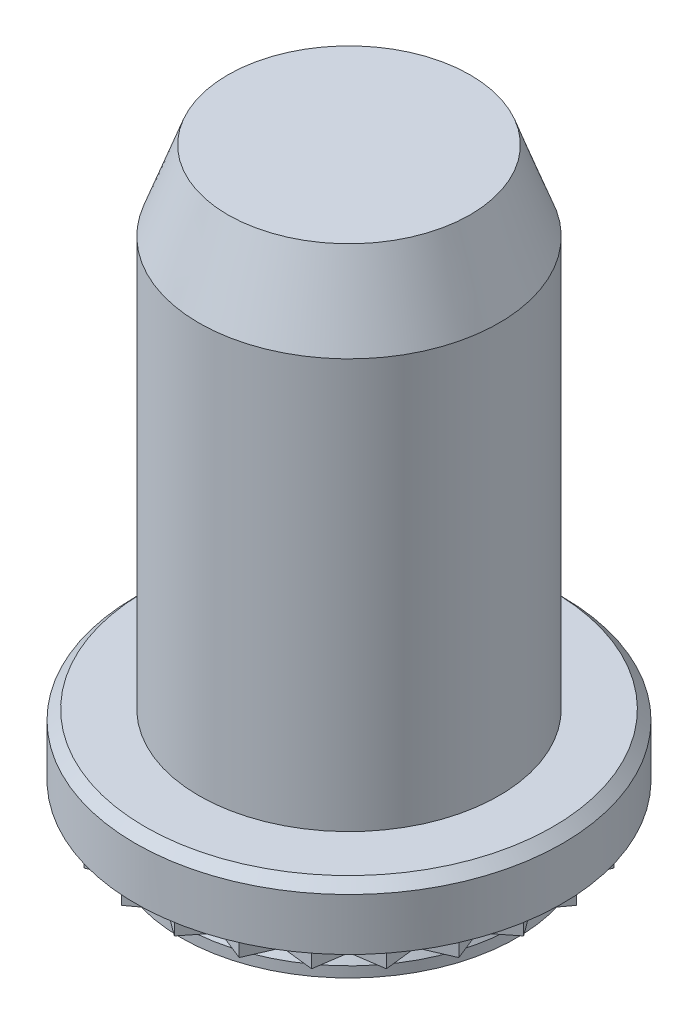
ISO-10303-21;
HEADER;
FILE_DESCRIPTION(('STEP AP214'),'2;1');
FILE_NAME('part.step','',(''),(''),'','','');
FILE_SCHEMA(('AUTOMOTIVE_DESIGN { 1 0 10303 214 1 1 1 1 }'));
ENDSEC;
DATA;
#1=APPLICATION_CONTEXT('core data for automotive mechanical design processes');
#2=APPLICATION_PROTOCOL_DEFINITION('international standard','automotive_design',2000,#1);
#3=PRODUCT_CONTEXT('',#1,'mechanical');
#4=PRODUCT('Part','Part','',(#3));
#5=PRODUCT_RELATED_PRODUCT_CATEGORY('part','',(#4));
#6=PRODUCT_DEFINITION_FORMATION('','',#4);
#7=PRODUCT_DEFINITION_CONTEXT('part definition',#1,'design');
#8=PRODUCT_DEFINITION('design','',#6,#7);
#9=PRODUCT_DEFINITION_SHAPE('','',#8);
#10=(LENGTH_UNIT() NAMED_UNIT(*) SI_UNIT(.MILLI.,.METRE.));
#11=(NAMED_UNIT(*) PLANE_ANGLE_UNIT() SI_UNIT($,.RADIAN.));
#12=(NAMED_UNIT(*) SI_UNIT($,.STERADIAN.) SOLID_ANGLE_UNIT());
#13=UNCERTAINTY_MEASURE_WITH_UNIT(LENGTH_MEASURE(1.E-05),#10,'distance_accuracy_value','');
#14=(GEOMETRIC_REPRESENTATION_CONTEXT(3) GLOBAL_UNCERTAINTY_ASSIGNED_CONTEXT((#13)) GLOBAL_UNIT_ASSIGNED_CONTEXT((#10,
#11,#12)) REPRESENTATION_CONTEXT('',''));
#15=CARTESIAN_POINT('',(0.,0.,0.));
#16=DIRECTION('',(0.,0.,1.));
#17=DIRECTION('',(1.,0.,0.));
#18=AXIS2_PLACEMENT_3D('',#15,#16,#17);
#19=CARTESIAN_POINT('',(5.2725,0.,0.));
#20=DIRECTION('',(0.,-1.,0.));
#21=DIRECTION('',(0.,0.,-1.));
#22=AXIS2_PLACEMENT_3D('',#19,#20,#21);
#23=PLANE('',#22);
#24=CARTESIAN_POINT('',(0.,0.,0.));
#25=DIRECTION('',(0.,-1.,0.));
#26=DIRECTION('',(0.,0.,-1.));
#27=AXIS2_PLACEMENT_3D('',#24,#25,#26);
#28=CIRCLE('',#27,5.55);
#29=CARTESIAN_POINT('',(0.,0.,-5.55));
#30=VERTEX_POINT('',#29);
#31=EDGE_CURVE('E759',#30,#30,#28,.T.);
#32=ORIENTED_EDGE('',*,*,#31,.T.);
#33=EDGE_LOOP('',(#32));
#34=FACE_BOUND('',#33,.T.);
#35=DIRECTION('',(0.398187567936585,0.,0.91730401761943));
#36=VECTOR('',#35,1.);
#37=CARTESIAN_POINT('',(-2.01769839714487,0.,4.87115483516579));
#38=LINE('',#37,#36);
#39=CARTESIAN_POINT('',(-2.35874999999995,0.,4.08547484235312));
#40=VERTEX_POINT('',#39);
#41=CARTESIAN_POINT('',(-2.01769839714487,0.,4.87115483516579));
#42=VERTEX_POINT('',#41);
#43=EDGE_CURVE('E660',#40,#42,#38,.T.);
#44=ORIENTED_EDGE('',*,*,#43,.T.);
#45=DIRECTION('',(0.930193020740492,0.,-0.367070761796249));
#46=VECTOR('',#45,1.);
#47=CARTESIAN_POINT('',(-1.22097884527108,0.,4.5567550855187));
#48=LINE('',#47,#46);
#49=CARTESIAN_POINT('',(-1.22097884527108,0.,4.5567550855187));
#50=VERTEX_POINT('',#49);
#51=EDGE_CURVE('E485',#42,#50,#48,.T.);
#52=ORIENTED_EDGE('',*,*,#51,.T.);
#53=DIRECTION('',(0.622035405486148,0.,0.782989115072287));
#54=VECTOR('',#53,1.);
#55=CARTESIAN_POINT('',(-0.688199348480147,0.,5.22739303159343));
#56=LINE('',#55,#54);
#57=CARTESIAN_POINT('',(-0.688199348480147,0.,5.22739303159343));
#58=VERTEX_POINT('',#57);
#59=EDGE_CURVE('E488',#50,#58,#56,.T.);
#60=ORIENTED_EDGE('',*,*,#59,.T.);
#61=DIRECTION('',(0.803492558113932,0.,-0.595314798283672));
#62=VECTOR('',#61,1.);
#63=CARTESIAN_POINT('',(0.,0.,4.7175));
#64=LINE('',#63,#62);
#65=CARTESIAN_POINT('',(0.,0.,4.7175));
#66=VERTEX_POINT('',#65);
#67=EDGE_CURVE('E712',#58,#66,#64,.T.);
#68=ORIENTED_EDGE('',*,*,#67,.T.);
#69=DIRECTION('',(0.803492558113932,0.,0.595314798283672));
#70=VECTOR('',#69,1.);
#71=CARTESIAN_POINT('',(0.688199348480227,0.,5.22739303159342));
#72=LINE('',#71,#70);
#73=CARTESIAN_POINT('',(0.688199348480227,0.,5.22739303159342));
#74=VERTEX_POINT('',#73);
#75=EDGE_CURVE('E715',#66,#74,#72,.T.);
#76=ORIENTED_EDGE('',*,*,#75,.T.);
#77=DIRECTION('',(0.622035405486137,0.,-0.782989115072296));
#78=VECTOR('',#77,1.);
#79=CARTESIAN_POINT('',(1.22097884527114,0.,4.55675508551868));
#80=LINE('',#79,#78);
#81=CARTESIAN_POINT('',(1.22097884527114,0.,4.55675508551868));
#82=VERTEX_POINT('',#81);
#83=EDGE_CURVE('E56',#74,#82,#80,.T.);
#84=ORIENTED_EDGE('',*,*,#83,.T.);
#85=DIRECTION('',(0.930193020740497,0.,0.367070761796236));
#86=VECTOR('',#85,1.);
#87=CARTESIAN_POINT('',(2.01769839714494,0.,4.87115483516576));
#88=LINE('',#87,#86);
#89=CARTESIAN_POINT('',(2.01769839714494,0.,4.87115483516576));
#90=VERTEX_POINT('',#89);
#91=EDGE_CURVE('E699',#82,#90,#88,.T.);
#92=ORIENTED_EDGE('',*,*,#91,.T.);
#93=DIRECTION('',(0.398187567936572,0.,-0.917304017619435));
#94=VECTOR('',#93,1.);
#95=CARTESIAN_POINT('',(2.35875,0.,4.08547484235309));
#96=LINE('',#95,#94);
#97=CARTESIAN_POINT('',(2.35875,0.,4.08547484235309));
#98=VERTEX_POINT('',#97);
#99=EDGE_CURVE('E530',#90,#98,#96,.T.);
#100=ORIENTED_EDGE('',*,*,#99,.T.);
#101=DIRECTION('',(0.993502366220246,0.,0.113811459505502));
#102=VECTOR('',#101,1.);
#103=CARTESIAN_POINT('',(3.20969463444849,0.,4.18295548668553));
#104=LINE('',#103,#102);
#105=CARTESIAN_POINT('',(3.20969463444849,0.,4.18295548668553));
#106=VERTEX_POINT('',#105);
#107=EDGE_CURVE('E525',#98,#106,#104,.T.);
#108=ORIENTED_EDGE('',*,*,#107,.T.);
#109=DIRECTION('',(0.147203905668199,0.,-0.989106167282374));
#110=VECTOR('',#109,1.);
#111=CARTESIAN_POINT('',(3.33577624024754,0.,3.33577624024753));
#112=LINE('',#111,#110);
#113=CARTESIAN_POINT('',(3.33577624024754,0.,3.33577624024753));
#114=VERTEX_POINT('',#113);
#115=EDGE_CURVE('E511',#106,#114,#112,.T.);
#116=ORIENTED_EDGE('',*,*,#115,.T.);
#117=DIRECTION('',(0.989106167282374,0.,-0.147203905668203));
#118=VECTOR('',#117,1.);
#119=CARTESIAN_POINT('',(4.18295548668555,0.,3.20969463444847));
#120=LINE('',#119,#118);
#121=CARTESIAN_POINT('',(4.18295548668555,0.,3.20969463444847));
#122=VERTEX_POINT('',#121);
#123=EDGE_CURVE('E514',#114,#122,#120,.T.);
#124=ORIENTED_EDGE('',*,*,#123,.T.);
#125=DIRECTION('',(-0.113811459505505,0.,-0.993502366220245));
#126=VECTOR('',#125,1.);
#127=CARTESIAN_POINT('',(4.08547484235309,0.,2.35874999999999));
#128=LINE('',#127,#126);
#129=CARTESIAN_POINT('',(4.08547484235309,0.,2.35874999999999));
#130=VERTEX_POINT('',#129);
#131=EDGE_CURVE('E685',#122,#130,#128,.T.);
#132=ORIENTED_EDGE('',*,*,#131,.T.);
#133=DIRECTION('',(0.917304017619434,0.,-0.398187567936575));
#134=VECTOR('',#133,1.);
#135=CARTESIAN_POINT('',(4.87115483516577,0.,2.01769839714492));
#136=LINE('',#135,#134);
#137=CARTESIAN_POINT('',(4.87115483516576,0.,2.01769839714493));
#138=VERTEX_POINT('',#137);
#139=EDGE_CURVE('E676',#130,#138,#136,.T.);
#140=ORIENTED_EDGE('',*,*,#139,.T.);
#141=DIRECTION('',(-0.367070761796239,0.,-0.930193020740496));
#142=VECTOR('',#141,1.);
#143=CARTESIAN_POINT('',(4.55675508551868,0.,1.22097884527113));
#144=LINE('',#143,#142);
#145=CARTESIAN_POINT('',(4.55675508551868,0.,1.22097884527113));
#146=VERTEX_POINT('',#145);
#147=EDGE_CURVE('E497',#138,#146,#144,.T.);
#148=ORIENTED_EDGE('',*,*,#147,.T.);
#149=DIRECTION('',(0.782989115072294,0.,-0.622035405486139));
#150=VECTOR('',#149,1.);
#151=CARTESIAN_POINT('',(5.22739303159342,0.,0.688199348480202));
#152=LINE('',#151,#150);
#153=CARTESIAN_POINT('',(5.22739303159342,0.,0.688199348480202));
#154=VERTEX_POINT('',#153);
#155=EDGE_CURVE('E500',#146,#154,#152,.T.);
#156=ORIENTED_EDGE('',*,*,#155,.T.);
#157=DIRECTION('',(-0.595314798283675,0.,-0.80349255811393));
#158=VECTOR('',#157,1.);
#159=CARTESIAN_POINT('',(4.7175,0.,0.));
#160=LINE('',#159,#158);
#161=CARTESIAN_POINT('',(4.7175,0.,0.));
#162=VERTEX_POINT('',#161);
#163=EDGE_CURVE('E545',#154,#162,#160,.T.);
#164=ORIENTED_EDGE('',*,*,#163,.T.);
#165=DIRECTION('',(0.59531479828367,0.,-0.803492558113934));
#166=VECTOR('',#165,1.);
#167=CARTESIAN_POINT('',(5.22739303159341,0.,-0.688199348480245));
#168=LINE('',#167,#166);
#169=CARTESIAN_POINT('',(5.22739303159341,0.,-0.688199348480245));
#170=VERTEX_POINT('',#169);
#171=EDGE_CURVE('E361',#162,#170,#168,.T.);
#172=ORIENTED_EDGE('',*,*,#171,.T.);
#173=DIRECTION('',(-0.782989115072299,0.,-0.622035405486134));
#174=VECTOR('',#173,1.);
#175=CARTESIAN_POINT('',(4.55675508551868,0.,-1.22097884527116));
#176=LINE('',#175,#174);
#177=CARTESIAN_POINT('',(4.55675508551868,0.,-1.22097884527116));
#178=VERTEX_POINT('',#177);
#179=EDGE_CURVE('E343',#170,#178,#176,.T.);
#180=ORIENTED_EDGE('',*,*,#179,.T.);
#181=DIRECTION('',(0.367070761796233,0.,-0.930193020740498));
#182=VECTOR('',#181,1.);
#183=CARTESIAN_POINT('',(4.87115483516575,0.,-2.01769839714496));
#184=LINE('',#183,#182);
#185=CARTESIAN_POINT('',(4.87115483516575,0.,-2.01769839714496));
#186=VERTEX_POINT('',#185);
#187=EDGE_CURVE('E351',#178,#186,#184,.T.);
#188=ORIENTED_EDGE('',*,*,#187,.T.);
#189=DIRECTION('',(-0.917304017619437,0.,-0.398187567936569));
#190=VECTOR('',#189,1.);
#191=CARTESIAN_POINT('',(4.08547484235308,0.,-2.35875000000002));
#192=LINE('',#191,#190);
#193=CARTESIAN_POINT('',(4.08547484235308,0.,-2.35875000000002));
#194=VERTEX_POINT('',#193);
#195=EDGE_CURVE('E559',#186,#194,#192,.T.);
#196=ORIENTED_EDGE('',*,*,#195,.T.);
#197=DIRECTION('',(0.113811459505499,0.,-0.993502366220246));
#198=VECTOR('',#197,1.);
#199=CARTESIAN_POINT('',(4.18295548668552,0.,-3.2096946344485));
#200=LINE('',#199,#198);
#201=CARTESIAN_POINT('',(4.18295548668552,0.,-3.2096946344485));
#202=VERTEX_POINT('',#201);
#203=EDGE_CURVE('E551',#194,#202,#200,.T.);
#204=ORIENTED_EDGE('',*,*,#203,.T.);
#205=DIRECTION('',(-0.989106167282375,0.,-0.147203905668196));
#206=VECTOR('',#205,1.);
#207=CARTESIAN_POINT('',(3.33577624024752,0.,-3.33577624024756));
#208=LINE('',#207,#206);
#209=CARTESIAN_POINT('',(3.33577624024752,0.,-3.33577624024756));
#210=VERTEX_POINT('',#209);
#211=EDGE_CURVE('E373',#202,#210,#208,.T.);
#212=ORIENTED_EDGE('',*,*,#211,.T.);
#213=DIRECTION('',(-0.147203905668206,0.,-0.989106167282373));
#214=VECTOR('',#213,1.);
#215=CARTESIAN_POINT('',(3.20969463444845,0.,-4.18295548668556));
#216=LINE('',#215,#214);
#217=CARTESIAN_POINT('',(3.20969463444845,0.,-4.18295548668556));
#218=VERTEX_POINT('',#217);
#219=EDGE_CURVE('E376',#210,#218,#216,.T.);
#220=ORIENTED_EDGE('',*,*,#219,.T.);
#221=DIRECTION('',(-0.993502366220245,0.,0.113811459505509));
#222=VECTOR('',#221,1.);
#223=CARTESIAN_POINT('',(2.35874999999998,0.,-4.0854748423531));
#224=LINE('',#223,#222);
#225=CARTESIAN_POINT('',(2.35874999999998,0.,-4.0854748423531));
#226=VERTEX_POINT('',#225);
#227=EDGE_CURVE('E574',#218,#226,#224,.T.);
#228=ORIENTED_EDGE('',*,*,#227,.T.);
#229=DIRECTION('',(-0.398187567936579,0.,-0.917304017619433));
#230=VECTOR('',#229,1.);
#231=CARTESIAN_POINT('',(2.0176983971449,0.,-4.87115483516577));
#232=LINE('',#231,#230);
#233=CARTESIAN_POINT('',(2.0176983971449,0.,-4.87115483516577));
#234=VERTEX_POINT('',#233);
#235=EDGE_CURVE('E565',#226,#234,#232,.T.);
#236=ORIENTED_EDGE('',*,*,#235,.T.);
#237=DIRECTION('',(-0.930193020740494,0.,0.367070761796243));
#238=VECTOR('',#237,1.);
#239=CARTESIAN_POINT('',(1.22097884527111,0.,-4.55675508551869));
#240=LINE('',#239,#238);
#241=CARTESIAN_POINT('',(1.22097884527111,0.,-4.55675508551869));
#242=VERTEX_POINT('',#241);
#243=EDGE_CURVE('E389',#234,#242,#240,.T.);
#244=ORIENTED_EDGE('',*,*,#243,.T.);
#245=DIRECTION('',(-0.622035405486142,0.,-0.782989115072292));
#246=VECTOR('',#245,1.);
#247=CARTESIAN_POINT('',(0.688199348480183,0.,-5.22739303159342));
#248=LINE('',#247,#246);
#249=CARTESIAN_POINT('',(0.688199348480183,0.,-5.22739303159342));
#250=VERTEX_POINT('',#249);
#251=EDGE_CURVE('E392',#242,#250,#248,.T.);
#252=ORIENTED_EDGE('',*,*,#251,.T.);
#253=DIRECTION('',(-0.803492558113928,0.,0.595314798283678));
#254=VECTOR('',#253,1.);
#255=CARTESIAN_POINT('',(0.,0.,-4.7175));
#256=LINE('',#255,#254);
#257=CARTESIAN_POINT('',(0.,0.,-4.7175));
#258=VERTEX_POINT('',#257);
#259=EDGE_CURVE('E590',#250,#258,#256,.T.);
#260=ORIENTED_EDGE('',*,*,#259,.T.);
#261=DIRECTION('',(-0.803492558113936,0.,-0.595314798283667));
#262=VECTOR('',#261,1.);
#263=CARTESIAN_POINT('',(-0.688199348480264,0.,-5.22739303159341));
#264=LINE('',#263,#262);
#265=CARTESIAN_POINT('',(-0.688199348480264,0.,-5.22739303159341));
#266=VERTEX_POINT('',#265);
#267=EDGE_CURVE('E580',#258,#266,#264,.T.);
#268=ORIENTED_EDGE('',*,*,#267,.T.);
#269=DIRECTION('',(-0.622035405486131,0.,0.782989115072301));
#270=VECTOR('',#269,1.);
#271=CARTESIAN_POINT('',(-1.22097884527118,0.,-4.55675508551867));
#272=LINE('',#271,#270);
#273=CARTESIAN_POINT('',(-1.22097884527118,0.,-4.55675508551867));
#274=VERTEX_POINT('',#273);
#275=EDGE_CURVE('E405',#266,#274,#272,.T.);
#276=ORIENTED_EDGE('',*,*,#275,.T.);
#277=DIRECTION('',(-0.930193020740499,0.,-0.36707076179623));
#278=VECTOR('',#277,1.);
#279=CARTESIAN_POINT('',(-2.01769839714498,0.,-4.87115483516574));
#280=LINE('',#279,#278);
#281=CARTESIAN_POINT('',(-2.01769839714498,0.,-4.87115483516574));
#282=VERTEX_POINT('',#281);
#283=EDGE_CURVE('E408',#274,#282,#280,.T.);
#284=ORIENTED_EDGE('',*,*,#283,.T.);
#285=DIRECTION('',(-0.398187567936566,0.,0.917304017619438));
#286=VECTOR('',#285,1.);
#287=CARTESIAN_POINT('',(-2.35875000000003,0.,-4.08547484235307));
#288=LINE('',#287,#286);
#289=CARTESIAN_POINT('',(-2.35875000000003,0.,-4.08547484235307));
#290=VERTEX_POINT('',#289);
#291=EDGE_CURVE('E606',#282,#290,#288,.T.);
#292=ORIENTED_EDGE('',*,*,#291,.T.);
#293=DIRECTION('',(-0.993502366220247,0.,-0.113811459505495));
#294=VECTOR('',#293,1.);
#295=CARTESIAN_POINT('',(-3.20969463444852,0.,-4.18295548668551));
#296=LINE('',#295,#294);
#297=CARTESIAN_POINT('',(-3.20969463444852,0.,-4.18295548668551));
#298=VERTEX_POINT('',#297);
#299=EDGE_CURVE('E596',#290,#298,#296,.T.);
#300=ORIENTED_EDGE('',*,*,#299,.T.);
#301=DIRECTION('',(-0.147203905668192,0.,0.989106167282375));
#302=VECTOR('',#301,1.);
#303=CARTESIAN_POINT('',(-3.33577624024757,0.,-3.33577624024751));
#304=LINE('',#303,#302);
#305=CARTESIAN_POINT('',(-3.33577624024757,0.,-3.33577624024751));
#306=VERTEX_POINT('',#305);
#307=EDGE_CURVE('E421',#298,#306,#304,.T.);
#308=ORIENTED_EDGE('',*,*,#307,.T.);
#309=DIRECTION('',(-0.989106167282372,0.,0.14720390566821));
#310=VECTOR('',#309,1.);
#311=CARTESIAN_POINT('',(-4.18295548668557,0.,-3.20969463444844));
#312=LINE('',#311,#310);
#313=CARTESIAN_POINT('',(-4.18295548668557,0.,-3.20969463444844));
#314=VERTEX_POINT('',#313);
#315=EDGE_CURVE('E424',#306,#314,#312,.T.);
#316=ORIENTED_EDGE('',*,*,#315,.T.);
#317=DIRECTION('',(0.113811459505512,0.,0.993502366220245));
#318=VECTOR('',#317,1.);
#319=CARTESIAN_POINT('',(-4.08547484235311,0.,-2.35874999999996));
#320=LINE('',#319,#318);
#321=CARTESIAN_POINT('',(-4.08547484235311,0.,-2.35874999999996));
#322=VERTEX_POINT('',#321);
#323=EDGE_CURVE('E622',#314,#322,#320,.T.);
#324=ORIENTED_EDGE('',*,*,#323,.T.);
#325=DIRECTION('',(-0.917304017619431,0.,0.398187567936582));
#326=VECTOR('',#325,1.);
#327=CARTESIAN_POINT('',(-4.87115483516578,0.,-2.01769839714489));
#328=LINE('',#327,#326);
#329=CARTESIAN_POINT('',(-4.87115483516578,0.,-2.01769839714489));
#330=VERTEX_POINT('',#329);
#331=EDGE_CURVE('E612',#322,#330,#328,.T.);
#332=ORIENTED_EDGE('',*,*,#331,.T.);
#333=DIRECTION('',(0.367070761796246,0.,0.930193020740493));
#334=VECTOR('',#333,1.);
#335=CARTESIAN_POINT('',(-4.55675508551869,0.,-1.2209788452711));
#336=LINE('',#335,#334);
#337=CARTESIAN_POINT('',(-4.55675508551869,0.,-1.2209788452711));
#338=VERTEX_POINT('',#337);
#339=EDGE_CURVE('E437',#330,#338,#336,.T.);
#340=ORIENTED_EDGE('',*,*,#339,.T.);
#341=DIRECTION('',(-0.78298911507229,0.,0.622035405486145));
#342=VECTOR('',#341,1.);
#343=CARTESIAN_POINT('',(-5.22739303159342,0.,-0.688199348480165));
#344=LINE('',#343,#342);
#345=CARTESIAN_POINT('',(-5.22739303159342,0.,-0.688199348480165));
#346=VERTEX_POINT('',#345);
#347=EDGE_CURVE('E440',#338,#346,#344,.T.);
#348=ORIENTED_EDGE('',*,*,#347,.T.);
#349=DIRECTION('',(0.595314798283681,0.,0.803492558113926));
#350=VECTOR('',#349,1.);
#351=CARTESIAN_POINT('',(-4.7175,0.,0.));
#352=LINE('',#351,#350);
#353=CARTESIAN_POINT('',(-4.7175,0.,0.));
#354=VERTEX_POINT('',#353);
#355=EDGE_CURVE('E638',#346,#354,#352,.T.);
#356=ORIENTED_EDGE('',*,*,#355,.T.);
#357=DIRECTION('',(-0.595314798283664,0.,0.803492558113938));
#358=VECTOR('',#357,1.);
#359=CARTESIAN_POINT('',(-5.22739303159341,0.,0.688199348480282));
#360=LINE('',#359,#358);
#361=CARTESIAN_POINT('',(-5.22739303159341,0.,0.688199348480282));
#362=VERTEX_POINT('',#361);
#363=EDGE_CURVE('E628',#354,#362,#360,.T.);
#364=ORIENTED_EDGE('',*,*,#363,.T.);
#365=DIRECTION('',(0.782989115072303,0.,0.622035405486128));
#366=VECTOR('',#365,1.);
#367=CARTESIAN_POINT('',(-4.55675508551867,0.,1.22097884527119));
#368=LINE('',#367,#366);
#369=CARTESIAN_POINT('',(-4.55675508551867,0.,1.22097884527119));
#370=VERTEX_POINT('',#369);
#371=EDGE_CURVE('E453',#362,#370,#368,.T.);
#372=ORIENTED_EDGE('',*,*,#371,.T.);
#373=DIRECTION('',(-0.367070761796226,0.,0.930193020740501));
#374=VECTOR('',#373,1.);
#375=CARTESIAN_POINT('',(-4.87115483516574,0.,2.01769839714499));
#376=LINE('',#375,#374);
#377=CARTESIAN_POINT('',(-4.87115483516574,0.,2.01769839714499));
#378=VERTEX_POINT('',#377);
#379=EDGE_CURVE('E456',#370,#378,#376,.T.);
#380=ORIENTED_EDGE('',*,*,#379,.T.);
#381=DIRECTION('',(0.91730401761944,0.,0.398187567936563));
#382=VECTOR('',#381,1.);
#383=CARTESIAN_POINT('',(-4.08547484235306,0.,2.35875000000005));
#384=LINE('',#383,#382);
#385=CARTESIAN_POINT('',(-4.08547484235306,0.,2.35875000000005));
#386=VERTEX_POINT('',#385);
#387=EDGE_CURVE('E654',#378,#386,#384,.T.);
#388=ORIENTED_EDGE('',*,*,#387,.T.);
#389=DIRECTION('',(-0.113811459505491,0.,0.993502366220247));
#390=VECTOR('',#389,1.);
#391=CARTESIAN_POINT('',(-4.1829554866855,0.,3.20969463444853));
#392=LINE('',#391,#390);
#393=CARTESIAN_POINT('',(-4.1829554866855,0.,3.20969463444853));
#394=VERTEX_POINT('',#393);
#395=EDGE_CURVE('E644',#386,#394,#392,.T.);
#396=ORIENTED_EDGE('',*,*,#395,.T.);
#397=DIRECTION('',(0.989106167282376,0.,0.147203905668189));
#398=VECTOR('',#397,1.);
#399=CARTESIAN_POINT('',(-3.3357762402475,0.,3.33577624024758));
#400=LINE('',#399,#398);
#401=CARTESIAN_POINT('',(-3.3357762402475,0.,3.33577624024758));
#402=VERTEX_POINT('',#401);
#403=EDGE_CURVE('E469',#394,#402,#400,.T.);
#404=ORIENTED_EDGE('',*,*,#403,.T.);
#405=DIRECTION('',(0.147203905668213,0.,0.989106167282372));
#406=VECTOR('',#405,1.);
#407=CARTESIAN_POINT('',(-3.20969463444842,0.,4.18295548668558));
#408=LINE('',#407,#406);
#409=CARTESIAN_POINT('',(-3.20969463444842,0.,4.18295548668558));
#410=VERTEX_POINT('',#409);
#411=EDGE_CURVE('E472',#402,#410,#408,.T.);
#412=ORIENTED_EDGE('',*,*,#411,.T.);
#413=DIRECTION('',(0.993502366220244,0.,-0.113811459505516));
#414=VECTOR('',#413,1.);
#415=CARTESIAN_POINT('',(-2.35874999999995,0.,4.08547484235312));
#416=LINE('',#415,#414);
#417=EDGE_CURVE('E670',#410,#40,#416,.T.);
#418=ORIENTED_EDGE('',*,*,#417,.T.);
#419=EDGE_LOOP('',(#44,#52,#60,#68,#76,#84,#92,#100,#108,#116,#124,#132,#140,#148,#156,#164,
#172,#180,#188,#196,#204,#212,#220,#228,#236,#244,#252,#260,#268,#276,#284,#292,#300,#308,#316,
#324,#332,#340,#348,#356,#364,#372,#380,#388,#396,#404,#412,#418));
#420=FACE_BOUND('',#419,.T.);
#421=ADVANCED_FACE('F32',(#34,#420),#23,.T.);
#422=CARTESIAN_POINT('',(0.,0.,0.));
#423=DIRECTION('',(0.,-1.,0.));
#424=DIRECTION('',(0.,0.,-1.));
#425=AXIS2_PLACEMENT_3D('',#422,#423,#424);
#426=CYLINDRICAL_SURFACE('',#425,5.55);
#427=CARTESIAN_POINT('',(0.,1.35,0.));
#428=DIRECTION('',(0.,1.,0.));
#429=DIRECTION('',(0.,0.,1.));
#430=AXIS2_PLACEMENT_3D('',#427,#428,#429);
#431=CIRCLE('',#430,5.55);
#432=CARTESIAN_POINT('',(0.,1.35,5.55));
#433=VERTEX_POINT('',#432);
#434=EDGE_CURVE('E762',#433,#433,#431,.F.);
#435=ORIENTED_EDGE('',*,*,#434,.T.);
#436=EDGE_LOOP('',(#435));
#437=FACE_BOUND('',#436,.T.);
#438=ORIENTED_EDGE('',*,*,#31,.F.);
#439=EDGE_LOOP('',(#438));
#440=FACE_BOUND('',#439,.T.);
#441=ADVANCED_FACE('F789',(#437,#440),#426,.T.);
#442=CARTESIAN_POINT('',(5.55,1.6,0.));
#443=DIRECTION('',(0.,1.,0.));
#444=DIRECTION('',(0.,0.,1.));
#445=AXIS2_PLACEMENT_3D('',#442,#443,#444);
#446=PLANE('',#445);
#447=CARTESIAN_POINT('',(0.,1.6,0.));
#448=DIRECTION('',(0.,1.,0.));
#449=DIRECTION('',(0.,0.,1.));
#450=AXIS2_PLACEMENT_3D('',#447,#448,#449);
#451=CIRCLE('',#450,5.3);
#452=CARTESIAN_POINT('',(0.,1.6,5.3));
#453=VERTEX_POINT('',#452);
#454=EDGE_CURVE('E765',#453,#453,#451,.T.);
#455=ORIENTED_EDGE('',*,*,#454,.T.);
#456=EDGE_LOOP('',(#455));
#457=FACE_BOUND('',#456,.T.);
#458=CARTESIAN_POINT('',(0.,1.6,0.));
#459=DIRECTION('',(0.,-1.,0.));
#460=DIRECTION('',(0.,0.,-1.));
#461=AXIS2_PLACEMENT_3D('',#458,#459,#460);
#462=CIRCLE('',#461,3.9);
#463=CARTESIAN_POINT('',(0.,1.6,-3.9));
#464=VERTEX_POINT('',#463);
#465=EDGE_CURVE('E756',#464,#464,#462,.T.);
#466=ORIENTED_EDGE('',*,*,#465,.T.);
#467=EDGE_LOOP('',(#466));
#468=FACE_BOUND('',#467,.T.);
#469=ADVANCED_FACE('F795',(#457,#468),#446,.T.);
#470=CARTESIAN_POINT('',(0.,0.,0.));
#471=DIRECTION('',(0.,-1.,0.));
#472=DIRECTION('',(0.,0.,-1.));
#473=AXIS2_PLACEMENT_3D('',#470,#471,#472);
#474=CYLINDRICAL_SURFACE('',#473,3.9);
#475=CARTESIAN_POINT('',(0.,12.239391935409,0.));
#476=DIRECTION('',(0.,1.,0.));
#477=DIRECTION('',(0.,0.,1.));
#478=AXIS2_PLACEMENT_3D('',#475,#476,#477);
#479=CIRCLE('',#478,3.9);
#480=CARTESIAN_POINT('',(0.,12.239391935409,3.9));
#481=VERTEX_POINT('',#480);
#482=EDGE_CURVE('E41',#481,#481,#479,.F.);
#483=ORIENTED_EDGE('',*,*,#482,.T.);
#484=EDGE_LOOP('',(#483));
#485=FACE_BOUND('',#484,.T.);
#486=ORIENTED_EDGE('',*,*,#465,.F.);
#487=EDGE_LOOP('',(#486));
#488=FACE_BOUND('',#487,.T.);
#489=ADVANCED_FACE('F771',(#485,#488),#474,.T.);
#490=CARTESIAN_POINT('',(3.9,14.3,0.));
#491=DIRECTION('',(0.,1.,0.));
#492=DIRECTION('',(0.,0.,1.));
#493=AXIS2_PLACEMENT_3D('',#490,#491,#492);
#494=PLANE('',#493);
#495=CARTESIAN_POINT('',(0.,14.3,0.));
#496=DIRECTION('',(0.,1.,0.));
#497=DIRECTION('',(0.,0.,1.));
#498=AXIS2_PLACEMENT_3D('',#495,#496,#497);
#499=CIRCLE('',#498,3.15);
#500=CARTESIAN_POINT('',(0.,14.3,3.15));
#501=VERTEX_POINT('',#500);
#502=EDGE_CURVE('E11',#501,#501,#499,.T.);
#503=ORIENTED_EDGE('',*,*,#502,.T.);
#504=EDGE_LOOP('',(#503));
#505=FACE_BOUND('',#504,.T.);
#506=ADVANCED_FACE('F804',(#505),#494,.T.);
#507=CARTESIAN_POINT('',(2.5,-1.37,0.));
#508=DIRECTION('',(0.,-1.,0.));
#509=DIRECTION('',(0.,0.,-1.));
#510=AXIS2_PLACEMENT_3D('',#507,#508,#509);
#511=PLANE('',#510);
#512=CARTESIAN_POINT('',(0.,-1.37,0.));
#513=DIRECTION('',(0.,-1.,0.));
#514=DIRECTION('',(0.,0.,-1.));
#515=AXIS2_PLACEMENT_3D('',#512,#513,#514);
#516=CIRCLE('',#515,3.);
#517=CARTESIAN_POINT('',(0.,-1.37,-3.));
#518=VERTEX_POINT('',#517);
#519=EDGE_CURVE('E36',#518,#518,#516,.T.);
#520=ORIENTED_EDGE('',*,*,#519,.F.);
#521=EDGE_LOOP('',(#520));
#522=FACE_BOUND('',#521,.T.);
#523=CARTESIAN_POINT('',(0.,-1.37,0.));
#524=DIRECTION('',(0.,-1.,0.));
#525=DIRECTION('',(0.,0.,-1.));
#526=AXIS2_PLACEMENT_3D('',#523,#524,#525);
#527=CIRCLE('',#526,4.36);
#528=CARTESIAN_POINT('',(0.,-1.37,-4.36));
#529=VERTEX_POINT('',#528);
#530=EDGE_CURVE('E750',#529,#529,#527,.T.);
#531=ORIENTED_EDGE('',*,*,#530,.T.);
#532=EDGE_LOOP('',(#531));
#533=FACE_BOUND('',#532,.T.);
#534=ADVANCED_FACE('F807',(#522,#533),#511,.T.);
#535=CARTESIAN_POINT('',(0.,0.,0.));
#536=DIRECTION('',(0.,-1.,0.));
#537=DIRECTION('',(0.,0.,-1.));
#538=AXIS2_PLACEMENT_3D('',#535,#536,#537);
#539=CYLINDRICAL_SURFACE('',#538,4.36);
#540=CARTESIAN_POINT('',(0.,-1.096,0.));
#541=DIRECTION('',(0.,-1.,0.));
#542=DIRECTION('',(0.,0.,-1.));
#543=AXIS2_PLACEMENT_3D('',#540,#541,#542);
#544=CIRCLE('',#543,4.36);
#545=CARTESIAN_POINT('',(0.,-1.096,-4.36));
#546=VERTEX_POINT('',#545);
#547=EDGE_CURVE('E747',#546,#546,#544,.T.);
#548=ORIENTED_EDGE('',*,*,#547,.T.);
#549=EDGE_LOOP('',(#548));
#550=FACE_BOUND('',#549,.T.);
#551=ORIENTED_EDGE('',*,*,#530,.F.);
#552=EDGE_LOOP('',(#551));
#553=FACE_BOUND('',#552,.T.);
#554=ADVANCED_FACE('F820',(#550,#553),#539,.T.);
#555=CARTESIAN_POINT('',(0.,-1.096,0.));
#556=DIRECTION('',(0.,-1.,0.));
#557=DIRECTION('',(0.,0.,-1.));
#558=AXIS2_PLACEMENT_3D('',#555,#556,#557);
#559=CONICAL_SURFACE('',#558,4.36,0.523598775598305);
#560=CARTESIAN_POINT('',(0.,-0.548,0.));
#561=DIRECTION('',(0.,-1.,0.));
#562=DIRECTION('',(0.,0.,-1.));
#563=AXIS2_PLACEMENT_3D('',#560,#561,#562);
#564=CIRCLE('',#563,4.04361205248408);
#565=CARTESIAN_POINT('',(0.,-0.548,-4.04361205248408));
#566=VERTEX_POINT('',#565);
#567=EDGE_CURVE('E744',#566,#566,#564,.T.);
#568=ORIENTED_EDGE('',*,*,#567,.T.);
#569=EDGE_LOOP('',(#568));
#570=FACE_BOUND('',#569,.T.);
#571=ORIENTED_EDGE('',*,*,#547,.F.);
#572=EDGE_LOOP('',(#571));
#573=FACE_BOUND('',#572,.T.);
#574=ADVANCED_FACE('F824',(#570,#573),#559,.T.);
#575=CARTESIAN_POINT('',(0.,0.,0.));
#576=DIRECTION('',(0.,-1.,0.));
#577=DIRECTION('',(0.,0.,-1.));
#578=AXIS2_PLACEMENT_3D('',#575,#576,#577);
#579=CYLINDRICAL_SURFACE('',#578,4.04361205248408);
#580=CARTESIAN_POINT('',(0.,0.,0.));
#581=DIRECTION('',(0.,-1.,0.));
#582=DIRECTION('',(0.,0.,-1.));
#583=AXIS2_PLACEMENT_3D('',#580,#581,#582);
#584=CIRCLE('',#583,4.04361205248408);
#585=CARTESIAN_POINT('',(0.,0.,-4.04361205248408));
#586=VERTEX_POINT('',#585);
#587=EDGE_CURVE('E741',#586,#586,#584,.T.);
#588=ORIENTED_EDGE('',*,*,#587,.T.);
#589=EDGE_LOOP('',(#588));
#590=FACE_BOUND('',#589,.T.);
#591=ORIENTED_EDGE('',*,*,#567,.F.);
#592=EDGE_LOOP('',(#591));
#593=FACE_BOUND('',#592,.T.);
#594=ADVANCED_FACE('F828',(#590,#593),#579,.T.);
#595=CARTESIAN_POINT('',(4.04361205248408,0.,0.));
#596=DIRECTION('',(0.,-1.,0.));
#597=DIRECTION('',(0.,0.,-1.));
#598=AXIS2_PLACEMENT_3D('',#595,#596,#597);
#599=PLANE('',#598);
#600=CARTESIAN_POINT('',(0.,0.,0.));
#601=DIRECTION('',(0.,-1.,0.));
#602=DIRECTION('',(0.,0.,-1.));
#603=AXIS2_PLACEMENT_3D('',#600,#601,#602);
#604=CIRCLE('',#603,4.36);
#605=CARTESIAN_POINT('',(0.,0.,-4.36));
#606=VERTEX_POINT('',#605);
#607=EDGE_CURVE('E738',#606,#606,#604,.T.);
#608=ORIENTED_EDGE('',*,*,#607,.T.);
#609=EDGE_LOOP('',(#608));
#610=FACE_BOUND('',#609,.T.);
#611=ORIENTED_EDGE('',*,*,#587,.F.);
#612=EDGE_LOOP('',(#611));
#613=FACE_BOUND('',#612,.T.);
#614=ADVANCED_FACE('F832',(#610,#613),#599,.T.);
#615=CARTESIAN_POINT('',(0.,0.,0.));
#616=DIRECTION('',(0.,-1.,0.));
#617=DIRECTION('',(0.,0.,-1.));
#618=AXIS2_PLACEMENT_3D('',#615,#616,#617);
#619=CYLINDRICAL_SURFACE('',#618,4.36);
#620=CARTESIAN_POINT('',(0.,-0.548,0.));
#621=DIRECTION('',(0.,-1.,0.));
#622=DIRECTION('',(0.,0.,-1.));
#623=AXIS2_PLACEMENT_3D('',#620,#621,#622);
#624=CIRCLE('',#623,4.36);
#625=CARTESIAN_POINT('',(0.,-0.548,-4.36));
#626=VERTEX_POINT('',#625);
#627=EDGE_CURVE('E735',#626,#626,#624,.T.);
#628=ORIENTED_EDGE('',*,*,#627,.T.);
#629=EDGE_LOOP('',(#628));
#630=FACE_BOUND('',#629,.T.);
#631=ORIENTED_EDGE('',*,*,#607,.F.);
#632=EDGE_LOOP('',(#631));
#633=FACE_BOUND('',#632,.T.);
#634=ADVANCED_FACE('F836',(#630,#633),#619,.F.);
#635=CARTESIAN_POINT('',(4.36,-0.548,0.));
#636=DIRECTION('',(0.,-1.,0.));
#637=DIRECTION('',(0.,0.,-1.));
#638=AXIS2_PLACEMENT_3D('',#635,#636,#637);
#639=PLANE('',#638);
#640=DIRECTION('',(0.782989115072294,0.,-0.622035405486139));
#641=VECTOR('',#640,1.);
#642=CARTESIAN_POINT('',(5.22739303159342,-0.548,0.688199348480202));
#643=LINE('',#642,#641);
#644=CARTESIAN_POINT('',(4.55675508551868,-0.548,1.22097884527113));
#645=VERTEX_POINT('',#644);
#646=CARTESIAN_POINT('',(5.22739303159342,-0.548,0.68819934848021));
#647=VERTEX_POINT('',#646);
#648=EDGE_CURVE('E48',#645,#647,#643,.T.);
#649=ORIENTED_EDGE('',*,*,#648,.F.);
#650=DIRECTION('',(-0.367070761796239,0.,-0.930193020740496));
#651=VECTOR('',#650,1.);
#652=CARTESIAN_POINT('',(4.55675508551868,-0.548,1.22097884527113));
#653=LINE('',#652,#651);
#654=CARTESIAN_POINT('',(4.87115483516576,-0.548,2.01769839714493));
#655=VERTEX_POINT('',#654);
#656=EDGE_CURVE('E371',#655,#645,#653,.T.);
#657=ORIENTED_EDGE('',*,*,#656,.F.);
#658=DIRECTION('',(0.917304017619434,0.,-0.398187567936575));
#659=VECTOR('',#658,1.);
#660=CARTESIAN_POINT('',(4.87115483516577,-0.548,2.01769839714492));
#661=LINE('',#660,#659);
#662=CARTESIAN_POINT('',(4.08547484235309,-0.548,2.35874999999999));
#663=VERTEX_POINT('',#662);
#664=EDGE_CURVE('E688',#663,#655,#661,.T.);
#665=ORIENTED_EDGE('',*,*,#664,.F.);
#666=DIRECTION('',(-0.113811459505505,0.,-0.993502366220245));
#667=VECTOR('',#666,1.);
#668=CARTESIAN_POINT('',(4.08547484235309,-0.548,2.35874999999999));
#669=LINE('',#668,#667);
#670=CARTESIAN_POINT('',(4.18295548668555,-0.548,3.20969463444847));
#671=VERTEX_POINT('',#670);
#672=EDGE_CURVE('E684',#671,#663,#669,.T.);
#673=ORIENTED_EDGE('',*,*,#672,.F.);
#674=DIRECTION('',(0.989106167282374,0.,-0.147203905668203));
#675=VECTOR('',#674,1.);
#676=CARTESIAN_POINT('',(4.18295548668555,-0.548,3.20969463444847));
#677=LINE('',#676,#675);
#678=CARTESIAN_POINT('',(3.33577624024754,-0.548,3.33577624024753));
#679=VERTEX_POINT('',#678);
#680=EDGE_CURVE('E515',#679,#671,#677,.T.);
#681=ORIENTED_EDGE('',*,*,#680,.F.);
#682=DIRECTION('',(0.147203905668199,0.,-0.989106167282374));
#683=VECTOR('',#682,1.);
#684=CARTESIAN_POINT('',(3.33577624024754,-0.548,3.33577624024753));
#685=LINE('',#684,#683);
#686=CARTESIAN_POINT('',(3.20969463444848,-0.548,4.18295548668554));
#687=VERTEX_POINT('',#686);
#688=EDGE_CURVE('E509',#687,#679,#685,.T.);
#689=ORIENTED_EDGE('',*,*,#688,.F.);
#690=DIRECTION('',(0.993502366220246,0.,0.113811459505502));
#691=VECTOR('',#690,1.);
#692=CARTESIAN_POINT('',(3.20969463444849,-0.548,4.18295548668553));
#693=LINE('',#692,#691);
#694=CARTESIAN_POINT('',(2.35875,-0.548,4.08547484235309));
#695=VERTEX_POINT('',#694);
#696=EDGE_CURVE('E533',#695,#687,#693,.T.);
#697=ORIENTED_EDGE('',*,*,#696,.F.);
#698=DIRECTION('',(0.398187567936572,0.,-0.917304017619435));
#699=VECTOR('',#698,1.);
#700=CARTESIAN_POINT('',(2.35875,-0.548,4.08547484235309));
#701=LINE('',#700,#699);
#702=CARTESIAN_POINT('',(2.01769839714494,-0.548,4.87115483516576));
#703=VERTEX_POINT('',#702);
#704=EDGE_CURVE('E529',#703,#695,#701,.T.);
#705=ORIENTED_EDGE('',*,*,#704,.F.);
#706=DIRECTION('',(0.930193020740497,0.,0.367070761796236));
#707=VECTOR('',#706,1.);
#708=CARTESIAN_POINT('',(2.01769839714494,-0.548,4.87115483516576));
#709=LINE('',#708,#707);
#710=CARTESIAN_POINT('',(1.22097884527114,-0.548,4.55675508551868));
#711=VERTEX_POINT('',#710);
#712=EDGE_CURVE('E700',#711,#703,#709,.T.);
#713=ORIENTED_EDGE('',*,*,#712,.F.);
#714=DIRECTION('',(0.622035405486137,0.,-0.782989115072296));
#715=VECTOR('',#714,1.);
#716=CARTESIAN_POINT('',(1.22097884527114,-0.548,4.55675508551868));
#717=LINE('',#716,#715);
#718=CARTESIAN_POINT('',(0.68819934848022,-0.548,5.22739303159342));
#719=VERTEX_POINT('',#718);
#720=EDGE_CURVE('E691',#719,#711,#717,.T.);
#721=ORIENTED_EDGE('',*,*,#720,.F.);
#722=DIRECTION('',(0.803492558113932,0.,0.595314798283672));
#723=VECTOR('',#722,1.);
#724=CARTESIAN_POINT('',(0.688199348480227,-0.548,5.22739303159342));
#725=LINE('',#724,#723);
#726=CARTESIAN_POINT('',(0.,-0.548,4.7175));
#727=VERTEX_POINT('',#726);
#728=EDGE_CURVE('E716',#727,#719,#725,.T.);
#729=ORIENTED_EDGE('',*,*,#728,.F.);
#730=DIRECTION('',(0.803492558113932,0.,-0.595314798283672));
#731=VECTOR('',#730,1.);
#732=CARTESIAN_POINT('',(0.,-0.548,4.7175));
#733=LINE('',#732,#731);
#734=CARTESIAN_POINT('',(-0.688199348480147,-0.548,5.22739303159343));
#735=VERTEX_POINT('',#734);
#736=EDGE_CURVE('E710',#735,#727,#733,.T.);
#737=ORIENTED_EDGE('',*,*,#736,.F.);
#738=DIRECTION('',(0.622035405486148,0.,0.782989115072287));
#739=VECTOR('',#738,1.);
#740=CARTESIAN_POINT('',(-0.688199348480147,-0.548,5.22739303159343));
#741=LINE('',#740,#739);
#742=CARTESIAN_POINT('',(-1.22097884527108,-0.548,4.5567550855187));
#743=VERTEX_POINT('',#742);
#744=EDGE_CURVE('E489',#743,#735,#741,.T.);
#745=ORIENTED_EDGE('',*,*,#744,.F.);
#746=DIRECTION('',(0.930193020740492,0.,-0.367070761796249));
#747=VECTOR('',#746,1.);
#748=CARTESIAN_POINT('',(-1.22097884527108,-0.548,4.5567550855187));
#749=LINE('',#748,#747);
#750=CARTESIAN_POINT('',(-2.01769839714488,-0.548,4.87115483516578));
#751=VERTEX_POINT('',#750);
#752=EDGE_CURVE('E492',#751,#743,#749,.T.);
#753=ORIENTED_EDGE('',*,*,#752,.F.);
#754=DIRECTION('',(0.398187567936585,0.,0.91730401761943));
#755=VECTOR('',#754,1.);
#756=CARTESIAN_POINT('',(-2.01769839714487,-0.548,4.87115483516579));
#757=LINE('',#756,#755);
#758=CARTESIAN_POINT('',(-2.35874999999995,-0.548,4.08547484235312));
#759=VERTEX_POINT('',#758);
#760=EDGE_CURVE('E673',#759,#751,#757,.T.);
#761=ORIENTED_EDGE('',*,*,#760,.F.);
#762=DIRECTION('',(0.993502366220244,0.,-0.113811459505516));
#763=VECTOR('',#762,1.);
#764=CARTESIAN_POINT('',(-2.35874999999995,-0.548,4.08547484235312));
#765=LINE('',#764,#763);
#766=CARTESIAN_POINT('',(-3.20969463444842,-0.548,4.18295548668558));
#767=VERTEX_POINT('',#766);
#768=EDGE_CURVE('E669',#767,#759,#765,.T.);
#769=ORIENTED_EDGE('',*,*,#768,.F.);
#770=DIRECTION('',(0.147203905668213,0.,0.989106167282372));
#771=VECTOR('',#770,1.);
#772=CARTESIAN_POINT('',(-3.20969463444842,-0.548,4.18295548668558));
#773=LINE('',#772,#771);
#774=CARTESIAN_POINT('',(-3.3357762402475,-0.548,3.33577624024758));
#775=VERTEX_POINT('',#774);
#776=EDGE_CURVE('E473',#775,#767,#773,.T.);
#777=ORIENTED_EDGE('',*,*,#776,.F.);
#778=DIRECTION('',(0.989106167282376,0.,0.147203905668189));
#779=VECTOR('',#778,1.);
#780=CARTESIAN_POINT('',(-3.3357762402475,-0.548,3.33577624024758));
#781=LINE('',#780,#779);
#782=CARTESIAN_POINT('',(-4.1829554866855,-0.548,3.20969463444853));
#783=VERTEX_POINT('',#782);
#784=EDGE_CURVE('E477',#783,#775,#781,.T.);
#785=ORIENTED_EDGE('',*,*,#784,.F.);
#786=DIRECTION('',(-0.113811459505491,0.,0.993502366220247));
#787=VECTOR('',#786,1.);
#788=CARTESIAN_POINT('',(-4.1829554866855,-0.548,3.20969463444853));
#789=LINE('',#788,#787);
#790=CARTESIAN_POINT('',(-4.08547484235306,-0.548,2.35875000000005));
#791=VERTEX_POINT('',#790);
#792=EDGE_CURVE('E657',#791,#783,#789,.T.);
#793=ORIENTED_EDGE('',*,*,#792,.F.);
#794=DIRECTION('',(0.91730401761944,0.,0.398187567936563));
#795=VECTOR('',#794,1.);
#796=CARTESIAN_POINT('',(-4.08547484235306,-0.548,2.35875000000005));
#797=LINE('',#796,#795);
#798=CARTESIAN_POINT('',(-4.87115483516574,-0.548,2.01769839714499));
#799=VERTEX_POINT('',#798);
#800=EDGE_CURVE('E653',#799,#791,#797,.T.);
#801=ORIENTED_EDGE('',*,*,#800,.F.);
#802=DIRECTION('',(-0.367070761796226,0.,0.930193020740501));
#803=VECTOR('',#802,1.);
#804=CARTESIAN_POINT('',(-4.87115483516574,-0.548,2.01769839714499));
#805=LINE('',#804,#803);
#806=CARTESIAN_POINT('',(-4.55675508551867,-0.548,1.22097884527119));
#807=VERTEX_POINT('',#806);
#808=EDGE_CURVE('E457',#807,#799,#805,.T.);
#809=ORIENTED_EDGE('',*,*,#808,.F.);
#810=DIRECTION('',(0.782989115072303,0.,0.622035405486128));
#811=VECTOR('',#810,1.);
#812=CARTESIAN_POINT('',(-4.55675508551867,-0.548,1.22097884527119));
#813=LINE('',#812,#811);
#814=CARTESIAN_POINT('',(-5.22739303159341,-0.548,0.688199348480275));
#815=VERTEX_POINT('',#814);
#816=EDGE_CURVE('E461',#815,#807,#813,.T.);
#817=ORIENTED_EDGE('',*,*,#816,.F.);
#818=DIRECTION('',(-0.595314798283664,0.,0.803492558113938));
#819=VECTOR('',#818,1.);
#820=CARTESIAN_POINT('',(-5.22739303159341,-0.548,0.688199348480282));
#821=LINE('',#820,#819);
#822=CARTESIAN_POINT('',(-4.7175,-0.548,0.));
#823=VERTEX_POINT('',#822);
#824=EDGE_CURVE('E641',#823,#815,#821,.T.);
#825=ORIENTED_EDGE('',*,*,#824,.F.);
#826=DIRECTION('',(0.595314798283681,0.,0.803492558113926));
#827=VECTOR('',#826,1.);
#828=CARTESIAN_POINT('',(-4.7175,-0.548,0.));
#829=LINE('',#828,#827);
#830=CARTESIAN_POINT('',(-5.22739303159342,-0.548,-0.688199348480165));
#831=VERTEX_POINT('',#830);
#832=EDGE_CURVE('E637',#831,#823,#829,.T.);
#833=ORIENTED_EDGE('',*,*,#832,.F.);
#834=DIRECTION('',(-0.78298911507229,0.,0.622035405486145));
#835=VECTOR('',#834,1.);
#836=CARTESIAN_POINT('',(-5.22739303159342,-0.548,-0.688199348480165));
#837=LINE('',#836,#835);
#838=CARTESIAN_POINT('',(-4.55675508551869,-0.548,-1.2209788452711));
#839=VERTEX_POINT('',#838);
#840=EDGE_CURVE('E441',#839,#831,#837,.T.);
#841=ORIENTED_EDGE('',*,*,#840,.F.);
#842=DIRECTION('',(0.367070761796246,0.,0.930193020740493));
#843=VECTOR('',#842,1.);
#844=CARTESIAN_POINT('',(-4.55675508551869,-0.548,-1.2209788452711));
#845=LINE('',#844,#843);
#846=CARTESIAN_POINT('',(-4.87115483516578,-0.548,-2.01769839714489));
#847=VERTEX_POINT('',#846);
#848=EDGE_CURVE('E445',#847,#839,#845,.T.);
#849=ORIENTED_EDGE('',*,*,#848,.F.);
#850=DIRECTION('',(-0.917304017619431,0.,0.398187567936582));
#851=VECTOR('',#850,1.);
#852=CARTESIAN_POINT('',(-4.87115483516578,-0.548,-2.01769839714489));
#853=LINE('',#852,#851);
#854=CARTESIAN_POINT('',(-4.08547484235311,-0.548,-2.35874999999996));
#855=VERTEX_POINT('',#854);
#856=EDGE_CURVE('E625',#855,#847,#853,.T.);
#857=ORIENTED_EDGE('',*,*,#856,.F.);
#858=DIRECTION('',(0.113811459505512,0.,0.993502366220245));
#859=VECTOR('',#858,1.);
#860=CARTESIAN_POINT('',(-4.08547484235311,-0.548,-2.35874999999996));
#861=LINE('',#860,#859);
#862=CARTESIAN_POINT('',(-4.18295548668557,-0.548,-3.20969463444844));
#863=VERTEX_POINT('',#862);
#864=EDGE_CURVE('E621',#863,#855,#861,.T.);
#865=ORIENTED_EDGE('',*,*,#864,.F.);
#866=DIRECTION('',(-0.989106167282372,0.,0.14720390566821));
#867=VECTOR('',#866,1.);
#868=CARTESIAN_POINT('',(-4.18295548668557,-0.548,-3.20969463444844));
#869=LINE('',#868,#867);
#870=CARTESIAN_POINT('',(-3.33577624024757,-0.548,-3.33577624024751));
#871=VERTEX_POINT('',#870);
#872=EDGE_CURVE('E425',#871,#863,#869,.T.);
#873=ORIENTED_EDGE('',*,*,#872,.F.);
#874=DIRECTION('',(-0.147203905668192,0.,0.989106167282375));
#875=VECTOR('',#874,1.);
#876=CARTESIAN_POINT('',(-3.33577624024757,-0.548,-3.33577624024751));
#877=LINE('',#876,#875);
#878=CARTESIAN_POINT('',(-3.20969463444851,-0.548,-4.18295548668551));
#879=VERTEX_POINT('',#878);
#880=EDGE_CURVE('E429',#879,#871,#877,.T.);
#881=ORIENTED_EDGE('',*,*,#880,.F.);
#882=DIRECTION('',(-0.993502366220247,0.,-0.113811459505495));
#883=VECTOR('',#882,1.);
#884=CARTESIAN_POINT('',(-3.20969463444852,-0.548,-4.18295548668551));
#885=LINE('',#884,#883);
#886=CARTESIAN_POINT('',(-2.35875000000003,-0.548,-4.08547484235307));
#887=VERTEX_POINT('',#886);
#888=EDGE_CURVE('E609',#887,#879,#885,.T.);
#889=ORIENTED_EDGE('',*,*,#888,.F.);
#890=DIRECTION('',(-0.398187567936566,0.,0.917304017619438));
#891=VECTOR('',#890,1.);
#892=CARTESIAN_POINT('',(-2.35875000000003,-0.548,-4.08547484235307));
#893=LINE('',#892,#891);
#894=CARTESIAN_POINT('',(-2.01769839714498,-0.548,-4.87115483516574));
#895=VERTEX_POINT('',#894);
#896=EDGE_CURVE('E605',#895,#887,#893,.T.);
#897=ORIENTED_EDGE('',*,*,#896,.F.);
#898=DIRECTION('',(-0.930193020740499,0.,-0.36707076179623));
#899=VECTOR('',#898,1.);
#900=CARTESIAN_POINT('',(-2.01769839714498,-0.548,-4.87115483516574));
#901=LINE('',#900,#899);
#902=CARTESIAN_POINT('',(-1.22097884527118,-0.548,-4.55675508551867));
#903=VERTEX_POINT('',#902);
#904=EDGE_CURVE('E409',#903,#895,#901,.T.);
#905=ORIENTED_EDGE('',*,*,#904,.F.);
#906=DIRECTION('',(-0.622035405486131,0.,0.782989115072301));
#907=VECTOR('',#906,1.);
#908=CARTESIAN_POINT('',(-1.22097884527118,-0.548,-4.55675508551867));
#909=LINE('',#908,#907);
#910=CARTESIAN_POINT('',(-0.688199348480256,-0.548,-5.22739303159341));
#911=VERTEX_POINT('',#910);
#912=EDGE_CURVE('E413',#911,#903,#909,.T.);
#913=ORIENTED_EDGE('',*,*,#912,.F.);
#914=DIRECTION('',(-0.803492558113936,0.,-0.595314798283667));
#915=VECTOR('',#914,1.);
#916=CARTESIAN_POINT('',(-0.688199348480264,-0.548,-5.22739303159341));
#917=LINE('',#916,#915);
#918=CARTESIAN_POINT('',(0.,-0.548,-4.7175));
#919=VERTEX_POINT('',#918);
#920=EDGE_CURVE('E593',#919,#911,#917,.T.);
#921=ORIENTED_EDGE('',*,*,#920,.F.);
#922=DIRECTION('',(-0.803492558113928,0.,0.595314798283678));
#923=VECTOR('',#922,1.);
#924=CARTESIAN_POINT('',(0.,-0.548,-4.7175));
#925=LINE('',#924,#923);
#926=CARTESIAN_POINT('',(0.688199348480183,-0.548,-5.22739303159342));
#927=VERTEX_POINT('',#926);
#928=EDGE_CURVE('E589',#927,#919,#925,.T.);
#929=ORIENTED_EDGE('',*,*,#928,.F.);
#930=DIRECTION('',(-0.622035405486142,0.,-0.782989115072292));
#931=VECTOR('',#930,1.);
#932=CARTESIAN_POINT('',(0.688199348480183,-0.548,-5.22739303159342));
#933=LINE('',#932,#931);
#934=CARTESIAN_POINT('',(1.22097884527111,-0.548,-4.55675508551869));
#935=VERTEX_POINT('',#934);
#936=EDGE_CURVE('E393',#935,#927,#933,.T.);
#937=ORIENTED_EDGE('',*,*,#936,.F.);
#938=DIRECTION('',(-0.930193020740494,0.,0.367070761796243));
#939=VECTOR('',#938,1.);
#940=CARTESIAN_POINT('',(1.22097884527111,-0.548,-4.55675508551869));
#941=LINE('',#940,#939);
#942=CARTESIAN_POINT('',(2.01769839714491,-0.548,-4.87115483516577));
#943=VERTEX_POINT('',#942);
#944=EDGE_CURVE('E397',#943,#935,#941,.T.);
#945=ORIENTED_EDGE('',*,*,#944,.F.);
#946=DIRECTION('',(-0.398187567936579,0.,-0.917304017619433));
#947=VECTOR('',#946,1.);
#948=CARTESIAN_POINT('',(2.0176983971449,-0.548,-4.87115483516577));
#949=LINE('',#948,#947);
#950=CARTESIAN_POINT('',(2.35874999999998,-0.548,-4.0854748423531));
#951=VERTEX_POINT('',#950);
#952=EDGE_CURVE('E577',#951,#943,#949,.T.);
#953=ORIENTED_EDGE('',*,*,#952,.F.);
#954=DIRECTION('',(-0.993502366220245,0.,0.113811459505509));
#955=VECTOR('',#954,1.);
#956=CARTESIAN_POINT('',(2.35874999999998,-0.548,-4.0854748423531));
#957=LINE('',#956,#955);
#958=CARTESIAN_POINT('',(3.20969463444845,-0.548,-4.18295548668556));
#959=VERTEX_POINT('',#958);
#960=EDGE_CURVE('E573',#959,#951,#957,.T.);
#961=ORIENTED_EDGE('',*,*,#960,.F.);
#962=DIRECTION('',(-0.147203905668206,0.,-0.989106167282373));
#963=VECTOR('',#962,1.);
#964=CARTESIAN_POINT('',(3.20969463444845,-0.548,-4.18295548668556));
#965=LINE('',#964,#963);
#966=CARTESIAN_POINT('',(3.33577624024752,-0.548,-3.33577624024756));
#967=VERTEX_POINT('',#966);
#968=EDGE_CURVE('E377',#967,#959,#965,.T.);
#969=ORIENTED_EDGE('',*,*,#968,.F.);
#970=DIRECTION('',(-0.989106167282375,0.,-0.147203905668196));
#971=VECTOR('',#970,1.);
#972=CARTESIAN_POINT('',(3.33577624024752,-0.548,-3.33577624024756));
#973=LINE('',#972,#971);
#974=CARTESIAN_POINT('',(4.18295548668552,-0.548,-3.2096946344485));
#975=VERTEX_POINT('',#974);
#976=EDGE_CURVE('E381',#975,#967,#973,.T.);
#977=ORIENTED_EDGE('',*,*,#976,.F.);
#978=DIRECTION('',(0.113811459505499,0.,-0.993502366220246));
#979=VECTOR('',#978,1.);
#980=CARTESIAN_POINT('',(4.18295548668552,-0.548,-3.2096946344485));
#981=LINE('',#980,#979);
#982=CARTESIAN_POINT('',(4.08547484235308,-0.548,-2.35875000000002));
#983=VERTEX_POINT('',#982);
#984=EDGE_CURVE('E562',#983,#975,#981,.T.);
#985=ORIENTED_EDGE('',*,*,#984,.F.);
#986=DIRECTION('',(-0.917304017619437,0.,-0.398187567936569));
#987=VECTOR('',#986,1.);
#988=CARTESIAN_POINT('',(4.08547484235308,-0.548,-2.35875000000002));
#989=LINE('',#988,#987);
#990=CARTESIAN_POINT('',(4.87115483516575,-0.548,-2.01769839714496));
#991=VERTEX_POINT('',#990);
#992=EDGE_CURVE('E558',#991,#983,#989,.T.);
#993=ORIENTED_EDGE('',*,*,#992,.F.);
#994=DIRECTION('',(0.367070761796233,0.,-0.930193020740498));
#995=VECTOR('',#994,1.);
#996=CARTESIAN_POINT('',(4.87115483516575,-0.548,-2.01769839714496));
#997=LINE('',#996,#995);
#998=CARTESIAN_POINT('',(4.55675508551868,-0.548,-1.22097884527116));
#999=VERTEX_POINT('',#998);
#1000=EDGE_CURVE('E362',#999,#991,#997,.T.);
#1001=ORIENTED_EDGE('',*,*,#1000,.F.);
#1002=DIRECTION('',(-0.782989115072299,0.,-0.622035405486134));
#1003=VECTOR('',#1002,1.);
#1004=CARTESIAN_POINT('',(4.55675508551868,-0.548,-1.22097884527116));
#1005=LINE('',#1004,#1003);
#1006=CARTESIAN_POINT('',(5.22739303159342,-0.548,-0.688199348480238));
#1007=VERTEX_POINT('',#1006);
#1008=EDGE_CURVE('E346',#1007,#999,#1005,.T.);
#1009=ORIENTED_EDGE('',*,*,#1008,.F.);
#1010=DIRECTION('',(0.59531479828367,0.,-0.803492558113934));
#1011=VECTOR('',#1010,1.);
#1012=CARTESIAN_POINT('',(5.22739303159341,-0.548,-0.688199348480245));
#1013=LINE('',#1012,#1011);
#1014=CARTESIAN_POINT('',(4.7175,-0.548,0.));
#1015=VERTEX_POINT('',#1014);
#1016=EDGE_CURVE('E548',#1015,#1007,#1013,.T.);
#1017=ORIENTED_EDGE('',*,*,#1016,.F.);
#1018=DIRECTION('',(-0.595314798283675,0.,-0.80349255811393));
#1019=VECTOR('',#1018,1.);
#1020=CARTESIAN_POINT('',(4.7175,-0.548,0.));
#1021=LINE('',#1020,#1019);
#1022=EDGE_CURVE('E544',#647,#1015,#1021,.T.);
#1023=ORIENTED_EDGE('',*,*,#1022,.F.);
#1024=EDGE_LOOP('',(#649,#657,#665,#673,#681,#689,#697,#705,#713,#721,#729,#737,#745,#753,#761,
#769,#777,#785,#793,#801,#809,#817,#825,#833,#841,#849,#857,#865,#873,#881,#889,#897,#905,#913,
#921,#929,#937,#945,#953,#961,#969,#977,#985,#993,#1001,#1009,#1017,#1023));
#1025=FACE_BOUND('',#1024,.T.);
#1026=ORIENTED_EDGE('',*,*,#627,.F.);
#1027=EDGE_LOOP('',(#1026));
#1028=FACE_BOUND('',#1027,.T.);
#1029=ADVANCED_FACE('F785',(#1025,#1028),#639,.T.);
#1030=CARTESIAN_POINT('',(0.,1.35,0.));
#1031=DIRECTION('',(0.,-1.,0.));
#1032=DIRECTION('',(0.,0.,-1.));
#1033=AXIS2_PLACEMENT_3D('',#1030,#1031,#1032);
#1034=CONICAL_SURFACE('',#1033,5.55,0.785398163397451);
#1035=ORIENTED_EDGE('',*,*,#454,.F.);
#1036=EDGE_LOOP('',(#1035));
#1037=FACE_BOUND('',#1036,.T.);
#1038=ORIENTED_EDGE('',*,*,#434,.F.);
#1039=EDGE_LOOP('',(#1038));
#1040=FACE_BOUND('',#1039,.T.);
#1041=ADVANCED_FACE('F776',(#1037,#1040),#1034,.T.);
#1042=CARTESIAN_POINT('',(0.,12.239391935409,0.));
#1043=DIRECTION('',(0.,-1.,0.));
#1044=DIRECTION('',(0.,0.,-1.));
#1045=AXIS2_PLACEMENT_3D('',#1042,#1043,#1044);
#1046=CONICAL_SURFACE('',#1045,3.9,0.349065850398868);
#1047=ORIENTED_EDGE('',*,*,#502,.F.);
#1048=EDGE_LOOP('',(#1047));
#1049=FACE_BOUND('',#1048,.T.);
#1050=ORIENTED_EDGE('',*,*,#482,.F.);
#1051=EDGE_LOOP('',(#1050));
#1052=FACE_BOUND('',#1051,.T.);
#1053=ADVANCED_FACE('F34',(#1049,#1052),#1046,.T.);
#1054=CARTESIAN_POINT('',(0.,-2.54,0.));
#1055=DIRECTION('',(0.,-1.,0.));
#1056=DIRECTION('',(0.,0.,-1.));
#1057=AXIS2_PLACEMENT_3D('',#1054,#1055,#1056);
#1058=CYLINDRICAL_SURFACE('',#1057,3.);
#1059=ORIENTED_EDGE('',*,*,#519,.T.);
#1060=EDGE_LOOP('',(#1059));
#1061=FACE_BOUND('',#1060,.T.);
#1062=CARTESIAN_POINT('',(0.,-0.87,0.));
#1063=DIRECTION('',(0.,-1.,0.));
#1064=DIRECTION('',(0.,0.,-1.));
#1065=AXIS2_PLACEMENT_3D('',#1062,#1063,#1064);
#1066=CIRCLE('',#1065,3.);
#1067=CARTESIAN_POINT('',(0.,-0.87,-3.));
#1068=VERTEX_POINT('',#1067);
#1069=EDGE_CURVE('E732',#1068,#1068,#1066,.T.);
#1070=ORIENTED_EDGE('',*,*,#1069,.F.);
#1071=EDGE_LOOP('',(#1070));
#1072=FACE_BOUND('',#1071,.T.);
#1073=ADVANCED_FACE('F775',(#1061,#1072),#1058,.F.);
#1074=CARTESIAN_POINT('',(0.,-0.87,0.));
#1075=DIRECTION('',(0.,-1.,0.));
#1076=DIRECTION('',(0.,0.,-1.));
#1077=AXIS2_PLACEMENT_3D('',#1074,#1075,#1076);
#1078=CONICAL_SURFACE('',#1077,3.,0.960105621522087);
#1079=CARTESIAN_POINT('',(0.,-0.520026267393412,0.));
#1080=DIRECTION('',(0.,-1.,0.));
#1081=DIRECTION('',(0.,0.,-1.));
#1082=AXIS2_PLACEMENT_3D('',#1079,#1080,#1081);
#1083=CIRCLE('',#1082,2.5);
#1084=CARTESIAN_POINT('',(0.,-0.520026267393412,-2.5));
#1085=VERTEX_POINT('',#1084);
#1086=EDGE_CURVE('E725',#1085,#1085,#1083,.T.);
#1087=ORIENTED_EDGE('',*,*,#1086,.F.);
#1088=EDGE_LOOP('',(#1087));
#1089=FACE_BOUND('',#1088,.T.);
#1090=ORIENTED_EDGE('',*,*,#1069,.T.);
#1091=EDGE_LOOP('',(#1090));
#1092=FACE_BOUND('',#1091,.T.);
#1093=ADVANCED_FACE('F782',(#1089,#1092),#1078,.F.);
#1094=CARTESIAN_POINT('',(0.,13.3,0.));
#1095=DIRECTION('',(0.,-1.,0.));
#1096=DIRECTION('',(0.,0.,-1.));
#1097=AXIS2_PLACEMENT_3D('',#1094,#1095,#1096);
#1098=CONICAL_SURFACE('',#1097,0.,1.17809724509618);
#1099=CARTESIAN_POINT('',(0.,12.2644660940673,0.));
#1100=DIRECTION('',(0.,-1.,0.));
#1101=DIRECTION('',(0.,0.,-1.));
#1102=AXIS2_PLACEMENT_3D('',#1099,#1100,#1101);
#1103=CIRCLE('',#1102,2.5);
#1104=CARTESIAN_POINT('',(0.,12.2644660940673,-2.5));
#1105=VERTEX_POINT('',#1104);
#1106=EDGE_CURVE('E753',#1105,#1105,#1103,.T.);
#1107=ORIENTED_EDGE('',*,*,#1106,.T.);
#1108=EDGE_LOOP('',(#1107));
#1109=FACE_BOUND('',#1108,.T.);
#1110=CARTESIAN_POINT('',(0.,13.3,0.));
#1111=VERTEX_POINT('',#1110);
#1112=VERTEX_LOOP('',#1111);
#1113=FACE_BOUND('',#1112,.T.);
#1114=ADVANCED_FACE('F809',(#1109,#1113),#1098,.F.);
#1115=CARTESIAN_POINT('',(0.,0.,0.));
#1116=DIRECTION('',(0.,-1.,0.));
#1117=DIRECTION('',(0.,0.,-1.));
#1118=AXIS2_PLACEMENT_3D('',#1115,#1116,#1117);
#1119=CYLINDRICAL_SURFACE('',#1118,2.5);
#1120=ORIENTED_EDGE('',*,*,#1086,.T.);
#1121=EDGE_LOOP('',(#1120));
#1122=FACE_BOUND('',#1121,.T.);
#1123=ORIENTED_EDGE('',*,*,#1106,.F.);
#1124=EDGE_LOOP('',(#1123));
#1125=FACE_BOUND('',#1124,.T.);
#1126=ADVANCED_FACE('F812',(#1122,#1125),#1119,.F.);
#1127=CARTESIAN_POINT('',(0.688199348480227,0.,5.22739303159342));
#1128=DIRECTION('',(0.595314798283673,0.,-0.803492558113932));
#1129=DIRECTION('',(-0.803492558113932,0.,-0.595314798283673));
#1130=AXIS2_PLACEMENT_3D('',#1127,#1128,#1129);
#1131=PLANE('',#1130);
#1132=ORIENTED_EDGE('',*,*,#728,.T.);
#1133=DIRECTION('',(0.,-1.,0.));
#1134=VECTOR('',#1133,1.);
#1135=CARTESIAN_POINT('',(0.688199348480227,0.,5.22739303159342));
#1136=LINE('',#1135,#1134);
#1137=EDGE_CURVE('E723',#74,#719,#1136,.T.);
#1138=ORIENTED_EDGE('',*,*,#1137,.F.);
#1139=ORIENTED_EDGE('',*,*,#75,.F.);
#1140=DIRECTION('',(0.,-1.,0.));
#1141=VECTOR('',#1140,1.);
#1142=CARTESIAN_POINT('',(0.,0.,4.7175));
#1143=LINE('',#1142,#1141);
#1144=EDGE_CURVE('E726',#66,#727,#1143,.T.);
#1145=ORIENTED_EDGE('',*,*,#1144,.T.);
#1146=EDGE_LOOP('',(#1132,#1138,#1139,#1145));
#1147=FACE_BOUND('',#1146,.T.);
#1148=ADVANCED_FACE('F816',(#1147),#1131,.F.);
#1149=CARTESIAN_POINT('',(0.,0.,4.7175));
#1150=DIRECTION('',(-0.595314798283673,0.,-0.803492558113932));
#1151=DIRECTION('',(-0.803492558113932,0.,0.595314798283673));
#1152=AXIS2_PLACEMENT_3D('',#1149,#1150,#1151);
#1153=PLANE('',#1152);
#1154=ORIENTED_EDGE('',*,*,#736,.T.);
#1155=ORIENTED_EDGE('',*,*,#1144,.F.);
#1156=ORIENTED_EDGE('',*,*,#67,.F.);
#1157=DIRECTION('',(0.,-1.,0.));
#1158=VECTOR('',#1157,1.);
#1159=CARTESIAN_POINT('',(-0.688199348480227,0.,5.22739303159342));
#1160=LINE('',#1159,#1158);
#1161=EDGE_CURVE('E718',#58,#735,#1160,.T.);
#1162=ORIENTED_EDGE('',*,*,#1161,.T.);
#1163=EDGE_LOOP('',(#1154,#1155,#1156,#1162));
#1164=FACE_BOUND('',#1163,.T.);
#1165=ADVANCED_FACE('F847',(#1164),#1153,.F.);
#1166=CARTESIAN_POINT('',(2.01769839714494,0.,4.87115483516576));
#1167=DIRECTION('',(0.367070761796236,0.,-0.930193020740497));
#1168=DIRECTION('',(-0.930193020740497,0.,-0.367070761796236));
#1169=AXIS2_PLACEMENT_3D('',#1166,#1167,#1168);
#1170=PLANE('',#1169);
#1171=ORIENTED_EDGE('',*,*,#712,.T.);
#1172=DIRECTION('',(0.,-1.,0.));
#1173=VECTOR('',#1172,1.);
#1174=CARTESIAN_POINT('',(2.01769839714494,0.,4.87115483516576));
#1175=LINE('',#1174,#1173);
#1176=EDGE_CURVE('E708',#90,#703,#1175,.T.);
#1177=ORIENTED_EDGE('',*,*,#1176,.F.);
#1178=ORIENTED_EDGE('',*,*,#91,.F.);
#1179=DIRECTION('',(0.,-1.,0.));
#1180=VECTOR('',#1179,1.);
#1181=CARTESIAN_POINT('',(1.22097884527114,0.,4.55675508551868));
#1182=LINE('',#1181,#1180);
#1183=EDGE_CURVE('E703',#82,#711,#1182,.T.);
#1184=ORIENTED_EDGE('',*,*,#1183,.T.);
#1185=EDGE_LOOP('',(#1171,#1177,#1178,#1184));
#1186=FACE_BOUND('',#1185,.T.);
#1187=ADVANCED_FACE('F850',(#1186),#1170,.F.);
#1188=CARTESIAN_POINT('',(1.22097884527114,0.,4.55675508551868));
#1189=DIRECTION('',(-0.782989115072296,0.,-0.622035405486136));
#1190=DIRECTION('',(-0.622035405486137,0.,0.782989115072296));
#1191=AXIS2_PLACEMENT_3D('',#1188,#1189,#1190);
#1192=PLANE('',#1191);
#1193=ORIENTED_EDGE('',*,*,#720,.T.);
#1194=ORIENTED_EDGE('',*,*,#1183,.F.);
#1195=ORIENTED_EDGE('',*,*,#83,.F.);
#1196=ORIENTED_EDGE('',*,*,#1137,.T.);
#1197=EDGE_LOOP('',(#1193,#1194,#1195,#1196));
#1198=FACE_BOUND('',#1197,.T.);
#1199=ADVANCED_FACE('F855',(#1198),#1192,.F.);
#1200=CARTESIAN_POINT('',(4.87115483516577,0.,2.01769839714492));
#1201=DIRECTION('',(-0.398187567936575,0.,-0.917304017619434));
#1202=DIRECTION('',(-0.917304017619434,0.,0.398187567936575));
#1203=AXIS2_PLACEMENT_3D('',#1200,#1201,#1202);
#1204=PLANE('',#1203);
#1205=ORIENTED_EDGE('',*,*,#664,.T.);
#1206=DIRECTION('',(0.,-1.,0.));
#1207=VECTOR('',#1206,1.);
#1208=CARTESIAN_POINT('',(4.87115483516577,0.,2.01769839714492));
#1209=LINE('',#1208,#1207);
#1210=EDGE_CURVE('E686',#138,#655,#1209,.T.);
#1211=ORIENTED_EDGE('',*,*,#1210,.F.);
#1212=ORIENTED_EDGE('',*,*,#139,.F.);
#1213=DIRECTION('',(0.,-1.,0.));
#1214=VECTOR('',#1213,1.);
#1215=CARTESIAN_POINT('',(4.08547484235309,0.,2.35874999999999));
#1216=LINE('',#1215,#1214);
#1217=EDGE_CURVE('E682',#130,#663,#1216,.T.);
#1218=ORIENTED_EDGE('',*,*,#1217,.T.);
#1219=EDGE_LOOP('',(#1205,#1211,#1212,#1218));
#1220=FACE_BOUND('',#1219,.T.);
#1221=ADVANCED_FACE('F858',(#1220),#1204,.F.);
#1222=CARTESIAN_POINT('',(4.08547484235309,0.,2.35874999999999));
#1223=DIRECTION('',(-0.993502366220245,0.,0.113811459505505));
#1224=DIRECTION('',(0.113811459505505,0.,0.993502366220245));
#1225=AXIS2_PLACEMENT_3D('',#1222,#1223,#1224);
#1226=PLANE('',#1225);
#1227=ORIENTED_EDGE('',*,*,#672,.T.);
#1228=ORIENTED_EDGE('',*,*,#1217,.F.);
#1229=ORIENTED_EDGE('',*,*,#131,.F.);
#1230=DIRECTION('',(0.,-1.,0.));
#1231=VECTOR('',#1230,1.);
#1232=CARTESIAN_POINT('',(4.18295548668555,0.,3.20969463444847));
#1233=LINE('',#1232,#1231);
#1234=EDGE_CURVE('E522',#122,#671,#1233,.T.);
#1235=ORIENTED_EDGE('',*,*,#1234,.T.);
#1236=EDGE_LOOP('',(#1227,#1228,#1229,#1235));
#1237=FACE_BOUND('',#1236,.T.);
#1238=ADVANCED_FACE('F864',(#1237),#1226,.F.);
#1239=CARTESIAN_POINT('',(-2.01769839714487,0.,4.87115483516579));
#1240=DIRECTION('',(0.91730401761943,0.,-0.398187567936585));
#1241=DIRECTION('',(-0.398187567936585,0.,-0.91730401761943));
#1242=AXIS2_PLACEMENT_3D('',#1239,#1240,#1241);
#1243=PLANE('',#1242);
#1244=ORIENTED_EDGE('',*,*,#760,.T.);
#1245=DIRECTION('',(0.,-1.,0.));
#1246=VECTOR('',#1245,1.);
#1247=CARTESIAN_POINT('',(-2.01769839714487,0.,4.87115483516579));
#1248=LINE('',#1247,#1246);
#1249=EDGE_CURVE('E671',#42,#751,#1248,.T.);
#1250=ORIENTED_EDGE('',*,*,#1249,.F.);
#1251=ORIENTED_EDGE('',*,*,#43,.F.);
#1252=DIRECTION('',(0.,-1.,0.));
#1253=VECTOR('',#1252,1.);
#1254=CARTESIAN_POINT('',(-2.35874999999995,0.,4.08547484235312));
#1255=LINE('',#1254,#1253);
#1256=EDGE_CURVE('E667',#40,#759,#1255,.T.);
#1257=ORIENTED_EDGE('',*,*,#1256,.T.);
#1258=EDGE_LOOP('',(#1244,#1250,#1251,#1257));
#1259=FACE_BOUND('',#1258,.T.);
#1260=ADVANCED_FACE('F868',(#1259),#1243,.F.);
#1261=CARTESIAN_POINT('',(-2.35874999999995,0.,4.08547484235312));
#1262=DIRECTION('',(-0.113811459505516,0.,-0.993502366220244));
#1263=DIRECTION('',(-0.993502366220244,0.,0.113811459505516));
#1264=AXIS2_PLACEMENT_3D('',#1261,#1262,#1263);
#1265=PLANE('',#1264);
#1266=ORIENTED_EDGE('',*,*,#768,.T.);
#1267=ORIENTED_EDGE('',*,*,#1256,.F.);
#1268=ORIENTED_EDGE('',*,*,#417,.F.);
#1269=DIRECTION('',(0.,-1.,0.));
#1270=VECTOR('',#1269,1.);
#1271=CARTESIAN_POINT('',(-3.20969463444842,0.,4.18295548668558));
#1272=LINE('',#1271,#1270);
#1273=EDGE_CURVE('E464',#410,#767,#1272,.T.);
#1274=ORIENTED_EDGE('',*,*,#1273,.T.);
#1275=EDGE_LOOP('',(#1266,#1267,#1268,#1274));
#1276=FACE_BOUND('',#1275,.T.);
#1277=ADVANCED_FACE('F872',(#1276),#1265,.F.);
#1278=CARTESIAN_POINT('',(-4.1829554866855,0.,3.20969463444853));
#1279=DIRECTION('',(0.993502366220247,0.,0.113811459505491));
#1280=DIRECTION('',(0.113811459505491,0.,-0.993502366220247));
#1281=AXIS2_PLACEMENT_3D('',#1278,#1279,#1280);
#1282=PLANE('',#1281);
#1283=ORIENTED_EDGE('',*,*,#792,.T.);
#1284=DIRECTION('',(0.,-1.,0.));
#1285=VECTOR('',#1284,1.);
#1286=CARTESIAN_POINT('',(-4.1829554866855,0.,3.20969463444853));
#1287=LINE('',#1286,#1285);
#1288=EDGE_CURVE('E655',#394,#783,#1287,.T.);
#1289=ORIENTED_EDGE('',*,*,#1288,.F.);
#1290=ORIENTED_EDGE('',*,*,#395,.F.);
#1291=DIRECTION('',(0.,-1.,0.));
#1292=VECTOR('',#1291,1.);
#1293=CARTESIAN_POINT('',(-4.08547484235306,0.,2.35875000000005));
#1294=LINE('',#1293,#1292);
#1295=EDGE_CURVE('E651',#386,#791,#1294,.T.);
#1296=ORIENTED_EDGE('',*,*,#1295,.T.);
#1297=EDGE_LOOP('',(#1283,#1289,#1290,#1296));
#1298=FACE_BOUND('',#1297,.T.);
#1299=ADVANCED_FACE('F876',(#1298),#1282,.F.);
#1300=CARTESIAN_POINT('',(-4.08547484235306,0.,2.35875000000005));
#1301=DIRECTION('',(0.398187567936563,0.,-0.91730401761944));
#1302=DIRECTION('',(-0.91730401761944,0.,-0.398187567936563));
#1303=AXIS2_PLACEMENT_3D('',#1300,#1301,#1302);
#1304=PLANE('',#1303);
#1305=ORIENTED_EDGE('',*,*,#800,.T.);
#1306=ORIENTED_EDGE('',*,*,#1295,.F.);
#1307=ORIENTED_EDGE('',*,*,#387,.F.);
#1308=DIRECTION('',(0.,-1.,0.));
#1309=VECTOR('',#1308,1.);
#1310=CARTESIAN_POINT('',(-4.87115483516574,0.,2.01769839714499));
#1311=LINE('',#1310,#1309);
#1312=EDGE_CURVE('E448',#378,#799,#1311,.T.);
#1313=ORIENTED_EDGE('',*,*,#1312,.T.);
#1314=EDGE_LOOP('',(#1305,#1306,#1307,#1313));
#1315=FACE_BOUND('',#1314,.T.);
#1316=ADVANCED_FACE('F880',(#1315),#1304,.F.);
#1317=CARTESIAN_POINT('',(-5.22739303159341,0.,0.688199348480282));
#1318=DIRECTION('',(0.803492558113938,0.,0.595314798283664));
#1319=DIRECTION('',(0.595314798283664,0.,-0.803492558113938));
#1320=AXIS2_PLACEMENT_3D('',#1317,#1318,#1319);
#1321=PLANE('',#1320);
#1322=ORIENTED_EDGE('',*,*,#824,.T.);
#1323=DIRECTION('',(0.,-1.,0.));
#1324=VECTOR('',#1323,1.);
#1325=CARTESIAN_POINT('',(-5.22739303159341,0.,0.688199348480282));
#1326=LINE('',#1325,#1324);
#1327=EDGE_CURVE('E639',#362,#815,#1326,.T.);
#1328=ORIENTED_EDGE('',*,*,#1327,.F.);
#1329=ORIENTED_EDGE('',*,*,#363,.F.);
#1330=DIRECTION('',(0.,-1.,0.));
#1331=VECTOR('',#1330,1.);
#1332=CARTESIAN_POINT('',(-4.7175,0.,0.));
#1333=LINE('',#1332,#1331);
#1334=EDGE_CURVE('E635',#354,#823,#1333,.T.);
#1335=ORIENTED_EDGE('',*,*,#1334,.T.);
#1336=EDGE_LOOP('',(#1322,#1328,#1329,#1335));
#1337=FACE_BOUND('',#1336,.T.);
#1338=ADVANCED_FACE('F884',(#1337),#1321,.F.);
#1339=CARTESIAN_POINT('',(-4.7175,0.,0.));
#1340=DIRECTION('',(0.803492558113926,0.,-0.595314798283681));
#1341=DIRECTION('',(-0.595314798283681,0.,-0.803492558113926));
#1342=AXIS2_PLACEMENT_3D('',#1339,#1340,#1341);
#1343=PLANE('',#1342);
#1344=ORIENTED_EDGE('',*,*,#832,.T.);
#1345=ORIENTED_EDGE('',*,*,#1334,.F.);
#1346=ORIENTED_EDGE('',*,*,#355,.F.);
#1347=DIRECTION('',(0.,-1.,0.));
#1348=VECTOR('',#1347,1.);
#1349=CARTESIAN_POINT('',(-5.22739303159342,0.,-0.688199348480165));
#1350=LINE('',#1349,#1348);
#1351=EDGE_CURVE('E432',#346,#831,#1350,.T.);
#1352=ORIENTED_EDGE('',*,*,#1351,.T.);
#1353=EDGE_LOOP('',(#1344,#1345,#1346,#1352));
#1354=FACE_BOUND('',#1353,.T.);
#1355=ADVANCED_FACE('F888',(#1354),#1343,.F.);
#1356=CARTESIAN_POINT('',(-4.87115483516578,0.,-2.01769839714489));
#1357=DIRECTION('',(0.398187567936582,0.,0.917304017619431));
#1358=DIRECTION('',(0.917304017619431,0.,-0.398187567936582));
#1359=AXIS2_PLACEMENT_3D('',#1356,#1357,#1358);
#1360=PLANE('',#1359);
#1361=ORIENTED_EDGE('',*,*,#856,.T.);
#1362=DIRECTION('',(0.,-1.,0.));
#1363=VECTOR('',#1362,1.);
#1364=CARTESIAN_POINT('',(-4.87115483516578,0.,-2.01769839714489));
#1365=LINE('',#1364,#1363);
#1366=EDGE_CURVE('E623',#330,#847,#1365,.T.);
#1367=ORIENTED_EDGE('',*,*,#1366,.F.);
#1368=ORIENTED_EDGE('',*,*,#331,.F.);
#1369=DIRECTION('',(0.,-1.,0.));
#1370=VECTOR('',#1369,1.);
#1371=CARTESIAN_POINT('',(-4.08547484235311,0.,-2.35874999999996));
#1372=LINE('',#1371,#1370);
#1373=EDGE_CURVE('E619',#322,#855,#1372,.T.);
#1374=ORIENTED_EDGE('',*,*,#1373,.T.);
#1375=EDGE_LOOP('',(#1361,#1367,#1368,#1374));
#1376=FACE_BOUND('',#1375,.T.);
#1377=ADVANCED_FACE('F892',(#1376),#1360,.F.);
#1378=CARTESIAN_POINT('',(-4.08547484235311,0.,-2.35874999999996));
#1379=DIRECTION('',(0.993502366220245,0.,-0.113811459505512));
#1380=DIRECTION('',(-0.113811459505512,0.,-0.993502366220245));
#1381=AXIS2_PLACEMENT_3D('',#1378,#1379,#1380);
#1382=PLANE('',#1381);
#1383=ORIENTED_EDGE('',*,*,#864,.T.);
#1384=ORIENTED_EDGE('',*,*,#1373,.F.);
#1385=ORIENTED_EDGE('',*,*,#323,.F.);
#1386=DIRECTION('',(0.,-1.,0.));
#1387=VECTOR('',#1386,1.);
#1388=CARTESIAN_POINT('',(-4.18295548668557,0.,-3.20969463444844));
#1389=LINE('',#1388,#1387);
#1390=EDGE_CURVE('E416',#314,#863,#1389,.T.);
#1391=ORIENTED_EDGE('',*,*,#1390,.T.);
#1392=EDGE_LOOP('',(#1383,#1384,#1385,#1391));
#1393=FACE_BOUND('',#1392,.T.);
#1394=ADVANCED_FACE('F896',(#1393),#1382,.F.);
#1395=CARTESIAN_POINT('',(-3.20969463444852,0.,-4.18295548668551));
#1396=DIRECTION('',(-0.113811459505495,0.,0.993502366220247));
#1397=DIRECTION('',(0.993502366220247,0.,0.113811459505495));
#1398=AXIS2_PLACEMENT_3D('',#1395,#1396,#1397);
#1399=PLANE('',#1398);
#1400=ORIENTED_EDGE('',*,*,#888,.T.);
#1401=DIRECTION('',(0.,-1.,0.));
#1402=VECTOR('',#1401,1.);
#1403=CARTESIAN_POINT('',(-3.20969463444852,0.,-4.18295548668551));
#1404=LINE('',#1403,#1402);
#1405=EDGE_CURVE('E607',#298,#879,#1404,.T.);
#1406=ORIENTED_EDGE('',*,*,#1405,.F.);
#1407=ORIENTED_EDGE('',*,*,#299,.F.);
#1408=DIRECTION('',(0.,-1.,0.));
#1409=VECTOR('',#1408,1.);
#1410=CARTESIAN_POINT('',(-2.35875000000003,0.,-4.08547484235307));
#1411=LINE('',#1410,#1409);
#1412=EDGE_CURVE('E603',#290,#887,#1411,.T.);
#1413=ORIENTED_EDGE('',*,*,#1412,.T.);
#1414=EDGE_LOOP('',(#1400,#1406,#1407,#1413));
#1415=FACE_BOUND('',#1414,.T.);
#1416=ADVANCED_FACE('F900',(#1415),#1399,.F.);
#1417=CARTESIAN_POINT('',(-2.35875000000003,0.,-4.08547484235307));
#1418=DIRECTION('',(0.917304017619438,0.,0.398187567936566));
#1419=DIRECTION('',(0.398187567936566,0.,-0.917304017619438));
#1420=AXIS2_PLACEMENT_3D('',#1417,#1418,#1419);
#1421=PLANE('',#1420);
#1422=ORIENTED_EDGE('',*,*,#896,.T.);
#1423=ORIENTED_EDGE('',*,*,#1412,.F.);
#1424=ORIENTED_EDGE('',*,*,#291,.F.);
#1425=DIRECTION('',(0.,-1.,0.));
#1426=VECTOR('',#1425,1.);
#1427=CARTESIAN_POINT('',(-2.01769839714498,0.,-4.87115483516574));
#1428=LINE('',#1427,#1426);
#1429=EDGE_CURVE('E400',#282,#895,#1428,.T.);
#1430=ORIENTED_EDGE('',*,*,#1429,.T.);
#1431=EDGE_LOOP('',(#1422,#1423,#1424,#1430));
#1432=FACE_BOUND('',#1431,.T.);
#1433=ADVANCED_FACE('F904',(#1432),#1421,.F.);
#1434=CARTESIAN_POINT('',(-0.688199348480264,0.,-5.22739303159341));
#1435=DIRECTION('',(-0.595314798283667,0.,0.803492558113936));
#1436=DIRECTION('',(0.803492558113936,0.,0.595314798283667));
#1437=AXIS2_PLACEMENT_3D('',#1434,#1435,#1436);
#1438=PLANE('',#1437);
#1439=ORIENTED_EDGE('',*,*,#920,.T.);
#1440=DIRECTION('',(0.,-1.,0.));
#1441=VECTOR('',#1440,1.);
#1442=CARTESIAN_POINT('',(-0.688199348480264,0.,-5.22739303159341));
#1443=LINE('',#1442,#1441);
#1444=EDGE_CURVE('E591',#266,#911,#1443,.T.);
#1445=ORIENTED_EDGE('',*,*,#1444,.F.);
#1446=ORIENTED_EDGE('',*,*,#267,.F.);
#1447=DIRECTION('',(0.,-1.,0.));
#1448=VECTOR('',#1447,1.);
#1449=CARTESIAN_POINT('',(0.,0.,-4.7175));
#1450=LINE('',#1449,#1448);
#1451=EDGE_CURVE('E587',#258,#919,#1450,.T.);
#1452=ORIENTED_EDGE('',*,*,#1451,.T.);
#1453=EDGE_LOOP('',(#1439,#1445,#1446,#1452));
#1454=FACE_BOUND('',#1453,.T.);
#1455=ADVANCED_FACE('F908',(#1454),#1438,.F.);
#1456=CARTESIAN_POINT('',(0.,0.,-4.7175));
#1457=DIRECTION('',(0.595314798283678,0.,0.803492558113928));
#1458=DIRECTION('',(0.803492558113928,0.,-0.595314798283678));
#1459=AXIS2_PLACEMENT_3D('',#1456,#1457,#1458);
#1460=PLANE('',#1459);
#1461=ORIENTED_EDGE('',*,*,#928,.T.);
#1462=ORIENTED_EDGE('',*,*,#1451,.F.);
#1463=ORIENTED_EDGE('',*,*,#259,.F.);
#1464=DIRECTION('',(0.,-1.,0.));
#1465=VECTOR('',#1464,1.);
#1466=CARTESIAN_POINT('',(0.688199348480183,0.,-5.22739303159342));
#1467=LINE('',#1466,#1465);
#1468=EDGE_CURVE('E384',#250,#927,#1467,.T.);
#1469=ORIENTED_EDGE('',*,*,#1468,.T.);
#1470=EDGE_LOOP('',(#1461,#1462,#1463,#1469));
#1471=FACE_BOUND('',#1470,.T.);
#1472=ADVANCED_FACE('F912',(#1471),#1460,.F.);
#1473=CARTESIAN_POINT('',(2.0176983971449,0.,-4.87115483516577));
#1474=DIRECTION('',(-0.917304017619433,0.,0.398187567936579));
#1475=DIRECTION('',(0.398187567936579,0.,0.917304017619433));
#1476=AXIS2_PLACEMENT_3D('',#1473,#1474,#1475);
#1477=PLANE('',#1476);
#1478=ORIENTED_EDGE('',*,*,#952,.T.);
#1479=DIRECTION('',(0.,-1.,0.));
#1480=VECTOR('',#1479,1.);
#1481=CARTESIAN_POINT('',(2.0176983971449,0.,-4.87115483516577));
#1482=LINE('',#1481,#1480);
#1483=EDGE_CURVE('E575',#234,#943,#1482,.T.);
#1484=ORIENTED_EDGE('',*,*,#1483,.F.);
#1485=ORIENTED_EDGE('',*,*,#235,.F.);
#1486=DIRECTION('',(0.,-1.,0.));
#1487=VECTOR('',#1486,1.);
#1488=CARTESIAN_POINT('',(2.35874999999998,0.,-4.0854748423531));
#1489=LINE('',#1488,#1487);
#1490=EDGE_CURVE('E571',#226,#951,#1489,.T.);
#1491=ORIENTED_EDGE('',*,*,#1490,.T.);
#1492=EDGE_LOOP('',(#1478,#1484,#1485,#1491));
#1493=FACE_BOUND('',#1492,.T.);
#1494=ADVANCED_FACE('F916',(#1493),#1477,.F.);
#1495=CARTESIAN_POINT('',(2.35874999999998,0.,-4.0854748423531));
#1496=DIRECTION('',(0.113811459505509,0.,0.993502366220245));
#1497=DIRECTION('',(0.993502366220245,0.,-0.113811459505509));
#1498=AXIS2_PLACEMENT_3D('',#1495,#1496,#1497);
#1499=PLANE('',#1498);
#1500=ORIENTED_EDGE('',*,*,#960,.T.);
#1501=ORIENTED_EDGE('',*,*,#1490,.F.);
#1502=ORIENTED_EDGE('',*,*,#227,.F.);
#1503=DIRECTION('',(0.,-1.,0.));
#1504=VECTOR('',#1503,1.);
#1505=CARTESIAN_POINT('',(3.20969463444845,0.,-4.18295548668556));
#1506=LINE('',#1505,#1504);
#1507=EDGE_CURVE('E369',#218,#959,#1506,.T.);
#1508=ORIENTED_EDGE('',*,*,#1507,.T.);
#1509=EDGE_LOOP('',(#1500,#1501,#1502,#1508));
#1510=FACE_BOUND('',#1509,.T.);
#1511=ADVANCED_FACE('F920',(#1510),#1499,.F.);
#1512=CARTESIAN_POINT('',(4.18295548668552,0.,-3.2096946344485));
#1513=DIRECTION('',(-0.993502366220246,0.,-0.113811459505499));
#1514=DIRECTION('',(-0.113811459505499,0.,0.993502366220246));
#1515=AXIS2_PLACEMENT_3D('',#1512,#1513,#1514);
#1516=PLANE('',#1515);
#1517=ORIENTED_EDGE('',*,*,#984,.T.);
#1518=DIRECTION('',(0.,-1.,0.));
#1519=VECTOR('',#1518,1.);
#1520=CARTESIAN_POINT('',(4.18295548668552,0.,-3.2096946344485));
#1521=LINE('',#1520,#1519);
#1522=EDGE_CURVE('E560',#202,#975,#1521,.T.);
#1523=ORIENTED_EDGE('',*,*,#1522,.F.);
#1524=ORIENTED_EDGE('',*,*,#203,.F.);
#1525=DIRECTION('',(0.,-1.,0.));
#1526=VECTOR('',#1525,1.);
#1527=CARTESIAN_POINT('',(4.08547484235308,0.,-2.35875000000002));
#1528=LINE('',#1527,#1526);
#1529=EDGE_CURVE('E556',#194,#983,#1528,.T.);
#1530=ORIENTED_EDGE('',*,*,#1529,.T.);
#1531=EDGE_LOOP('',(#1517,#1523,#1524,#1530));
#1532=FACE_BOUND('',#1531,.T.);
#1533=ADVANCED_FACE('F924',(#1532),#1516,.F.);
#1534=CARTESIAN_POINT('',(4.08547484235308,0.,-2.35875000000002));
#1535=DIRECTION('',(-0.398187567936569,0.,0.917304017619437));
#1536=DIRECTION('',(0.917304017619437,0.,0.398187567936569));
#1537=AXIS2_PLACEMENT_3D('',#1534,#1535,#1536);
#1538=PLANE('',#1537);
#1539=ORIENTED_EDGE('',*,*,#992,.T.);
#1540=ORIENTED_EDGE('',*,*,#1529,.F.);
#1541=ORIENTED_EDGE('',*,*,#195,.F.);
#1542=DIRECTION('',(0.,-1.,0.));
#1543=VECTOR('',#1542,1.);
#1544=CARTESIAN_POINT('',(4.87115483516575,0.,-2.01769839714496));
#1545=LINE('',#1544,#1543);
#1546=EDGE_CURVE('E350',#186,#991,#1545,.T.);
#1547=ORIENTED_EDGE('',*,*,#1546,.T.);
#1548=EDGE_LOOP('',(#1539,#1540,#1541,#1547));
#1549=FACE_BOUND('',#1548,.T.);
#1550=ADVANCED_FACE('F928',(#1549),#1538,.F.);
#1551=CARTESIAN_POINT('',(5.22739303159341,0.,-0.688199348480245));
#1552=DIRECTION('',(-0.803492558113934,0.,-0.59531479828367));
#1553=DIRECTION('',(-0.59531479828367,0.,0.803492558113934));
#1554=AXIS2_PLACEMENT_3D('',#1551,#1552,#1553);
#1555=PLANE('',#1554);
#1556=ORIENTED_EDGE('',*,*,#1016,.T.);
#1557=DIRECTION('',(0.,-1.,0.));
#1558=VECTOR('',#1557,1.);
#1559=CARTESIAN_POINT('',(5.22739303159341,0.,-0.688199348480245));
#1560=LINE('',#1559,#1558);
#1561=EDGE_CURVE('E546',#170,#1007,#1560,.T.);
#1562=ORIENTED_EDGE('',*,*,#1561,.F.);
#1563=ORIENTED_EDGE('',*,*,#171,.F.);
#1564=DIRECTION('',(0.,-1.,0.));
#1565=VECTOR('',#1564,1.);
#1566=CARTESIAN_POINT('',(4.7175,0.,0.));
#1567=LINE('',#1566,#1565);
#1568=EDGE_CURVE('E542',#162,#1015,#1567,.T.);
#1569=ORIENTED_EDGE('',*,*,#1568,.T.);
#1570=EDGE_LOOP('',(#1556,#1562,#1563,#1569));
#1571=FACE_BOUND('',#1570,.T.);
#1572=ADVANCED_FACE('F932',(#1571),#1555,.F.);
#1573=CARTESIAN_POINT('',(4.7175,0.,0.));
#1574=DIRECTION('',(-0.80349255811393,0.,0.595314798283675));
#1575=DIRECTION('',(0.595314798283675,0.,0.80349255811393));
#1576=AXIS2_PLACEMENT_3D('',#1573,#1574,#1575);
#1577=PLANE('',#1576);
#1578=ORIENTED_EDGE('',*,*,#1022,.T.);
#1579=ORIENTED_EDGE('',*,*,#1568,.F.);
#1580=ORIENTED_EDGE('',*,*,#163,.F.);
#1581=DIRECTION('',(0.,-1.,0.));
#1582=VECTOR('',#1581,1.);
#1583=CARTESIAN_POINT('',(5.22739303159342,0.,0.688199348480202));
#1584=LINE('',#1583,#1582);
#1585=EDGE_CURVE('E507',#154,#647,#1584,.T.);
#1586=ORIENTED_EDGE('',*,*,#1585,.T.);
#1587=EDGE_LOOP('',(#1578,#1579,#1580,#1586));
#1588=FACE_BOUND('',#1587,.T.);
#1589=ADVANCED_FACE('F936',(#1588),#1577,.F.);
#1590=CARTESIAN_POINT('',(3.20969463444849,0.,4.18295548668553));
#1591=DIRECTION('',(0.113811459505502,0.,-0.993502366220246));
#1592=DIRECTION('',(-0.993502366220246,0.,-0.113811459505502));
#1593=AXIS2_PLACEMENT_3D('',#1590,#1591,#1592);
#1594=PLANE('',#1593);
#1595=ORIENTED_EDGE('',*,*,#696,.T.);
#1596=DIRECTION('',(0.,-1.,0.));
#1597=VECTOR('',#1596,1.);
#1598=CARTESIAN_POINT('',(3.20969463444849,0.,4.18295548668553));
#1599=LINE('',#1598,#1597);
#1600=EDGE_CURVE('E531',#106,#687,#1599,.T.);
#1601=ORIENTED_EDGE('',*,*,#1600,.F.);
#1602=ORIENTED_EDGE('',*,*,#107,.F.);
#1603=DIRECTION('',(0.,-1.,0.));
#1604=VECTOR('',#1603,1.);
#1605=CARTESIAN_POINT('',(2.35875,0.,4.08547484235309));
#1606=LINE('',#1605,#1604);
#1607=EDGE_CURVE('E527',#98,#695,#1606,.T.);
#1608=ORIENTED_EDGE('',*,*,#1607,.T.);
#1609=EDGE_LOOP('',(#1595,#1601,#1602,#1608));
#1610=FACE_BOUND('',#1609,.T.);
#1611=ADVANCED_FACE('F940',(#1610),#1594,.F.);
#1612=CARTESIAN_POINT('',(2.35875,0.,4.08547484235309));
#1613=DIRECTION('',(-0.917304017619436,0.,-0.398187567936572));
#1614=DIRECTION('',(-0.398187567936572,0.,0.917304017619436));
#1615=AXIS2_PLACEMENT_3D('',#1612,#1613,#1614);
#1616=PLANE('',#1615);
#1617=ORIENTED_EDGE('',*,*,#704,.T.);
#1618=ORIENTED_EDGE('',*,*,#1607,.F.);
#1619=ORIENTED_EDGE('',*,*,#99,.F.);
#1620=ORIENTED_EDGE('',*,*,#1176,.T.);
#1621=EDGE_LOOP('',(#1617,#1618,#1619,#1620));
#1622=FACE_BOUND('',#1621,.T.);
#1623=ADVANCED_FACE('F944',(#1622),#1616,.F.);
#1624=CARTESIAN_POINT('',(4.18295548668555,0.,3.20969463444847));
#1625=DIRECTION('',(-0.147203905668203,0.,-0.989106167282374));
#1626=DIRECTION('',(-0.989106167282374,0.,0.147203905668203));
#1627=AXIS2_PLACEMENT_3D('',#1624,#1625,#1626);
#1628=PLANE('',#1627);
#1629=ORIENTED_EDGE('',*,*,#680,.T.);
#1630=ORIENTED_EDGE('',*,*,#1234,.F.);
#1631=ORIENTED_EDGE('',*,*,#123,.F.);
#1632=DIRECTION('',(0.,-1.,0.));
#1633=VECTOR('',#1632,1.);
#1634=CARTESIAN_POINT('',(3.33577624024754,0.,3.33577624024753));
#1635=LINE('',#1634,#1633);
#1636=EDGE_CURVE('E518',#114,#679,#1635,.T.);
#1637=ORIENTED_EDGE('',*,*,#1636,.T.);
#1638=EDGE_LOOP('',(#1629,#1630,#1631,#1637));
#1639=FACE_BOUND('',#1638,.T.);
#1640=ADVANCED_FACE('F948',(#1639),#1628,.F.);
#1641=CARTESIAN_POINT('',(3.33577624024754,0.,3.33577624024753));
#1642=DIRECTION('',(-0.989106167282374,0.,-0.147203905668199));
#1643=DIRECTION('',(-0.147203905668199,0.,0.989106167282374));
#1644=AXIS2_PLACEMENT_3D('',#1641,#1642,#1643);
#1645=PLANE('',#1644);
#1646=ORIENTED_EDGE('',*,*,#688,.T.);
#1647=ORIENTED_EDGE('',*,*,#1636,.F.);
#1648=ORIENTED_EDGE('',*,*,#115,.F.);
#1649=ORIENTED_EDGE('',*,*,#1600,.T.);
#1650=EDGE_LOOP('',(#1646,#1647,#1648,#1649));
#1651=FACE_BOUND('',#1650,.T.);
#1652=ADVANCED_FACE('F950',(#1651),#1645,.F.);
#1653=CARTESIAN_POINT('',(5.22739303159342,0.,0.688199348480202));
#1654=DIRECTION('',(-0.622035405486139,0.,-0.782989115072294));
#1655=DIRECTION('',(-0.782989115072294,0.,0.622035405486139));
#1656=AXIS2_PLACEMENT_3D('',#1653,#1654,#1655);
#1657=PLANE('',#1656);
#1658=ORIENTED_EDGE('',*,*,#648,.T.);
#1659=ORIENTED_EDGE('',*,*,#1585,.F.);
#1660=ORIENTED_EDGE('',*,*,#155,.F.);
#1661=DIRECTION('',(0.,-1.,0.));
#1662=VECTOR('',#1661,1.);
#1663=CARTESIAN_POINT('',(4.55675508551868,0.,1.22097884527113));
#1664=LINE('',#1663,#1662);
#1665=EDGE_CURVE('E503',#146,#645,#1664,.T.);
#1666=ORIENTED_EDGE('',*,*,#1665,.T.);
#1667=EDGE_LOOP('',(#1658,#1659,#1660,#1666));
#1668=FACE_BOUND('',#1667,.T.);
#1669=ADVANCED_FACE('F953',(#1668),#1657,.F.);
#1670=CARTESIAN_POINT('',(4.55675508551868,0.,1.22097884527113));
#1671=DIRECTION('',(-0.930193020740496,0.,0.367070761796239));
#1672=DIRECTION('',(0.367070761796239,0.,0.930193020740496));
#1673=AXIS2_PLACEMENT_3D('',#1670,#1671,#1672);
#1674=PLANE('',#1673);
#1675=ORIENTED_EDGE('',*,*,#656,.T.);
#1676=ORIENTED_EDGE('',*,*,#1665,.F.);
#1677=ORIENTED_EDGE('',*,*,#147,.F.);
#1678=ORIENTED_EDGE('',*,*,#1210,.T.);
#1679=EDGE_LOOP('',(#1675,#1676,#1677,#1678));
#1680=FACE_BOUND('',#1679,.T.);
#1681=ADVANCED_FACE('F958',(#1680),#1674,.F.);
#1682=CARTESIAN_POINT('',(4.87115483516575,0.,-2.01769839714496));
#1683=DIRECTION('',(-0.930193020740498,0.,-0.367070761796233));
#1684=DIRECTION('',(-0.367070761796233,0.,0.930193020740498));
#1685=AXIS2_PLACEMENT_3D('',#1682,#1683,#1684);
#1686=PLANE('',#1685);
#1687=ORIENTED_EDGE('',*,*,#1000,.T.);
#1688=ORIENTED_EDGE('',*,*,#1546,.F.);
#1689=ORIENTED_EDGE('',*,*,#187,.F.);
#1690=DIRECTION('',(0.,-1.,0.));
#1691=VECTOR('',#1690,1.);
#1692=CARTESIAN_POINT('',(4.55675508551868,0.,-1.22097884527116));
#1693=LINE('',#1692,#1691);
#1694=EDGE_CURVE('E340',#178,#999,#1693,.T.);
#1695=ORIENTED_EDGE('',*,*,#1694,.T.);
#1696=EDGE_LOOP('',(#1687,#1688,#1689,#1695));
#1697=FACE_BOUND('',#1696,.T.);
#1698=ADVANCED_FACE('F364',(#1697),#1686,.F.);
#1699=CARTESIAN_POINT('',(4.55675508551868,0.,-1.22097884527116));
#1700=DIRECTION('',(-0.622035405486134,0.,0.782989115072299));
#1701=DIRECTION('',(0.782989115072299,0.,0.622035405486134));
#1702=AXIS2_PLACEMENT_3D('',#1699,#1700,#1701);
#1703=PLANE('',#1702);
#1704=ORIENTED_EDGE('',*,*,#1008,.T.);
#1705=ORIENTED_EDGE('',*,*,#1694,.F.);
#1706=ORIENTED_EDGE('',*,*,#179,.F.);
#1707=ORIENTED_EDGE('',*,*,#1561,.T.);
#1708=EDGE_LOOP('',(#1704,#1705,#1706,#1707));
#1709=FACE_BOUND('',#1708,.T.);
#1710=ADVANCED_FACE('F342',(#1709),#1703,.F.);
#1711=CARTESIAN_POINT('',(3.20969463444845,0.,-4.18295548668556));
#1712=DIRECTION('',(-0.989106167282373,0.,0.147203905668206));
#1713=DIRECTION('',(0.147203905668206,0.,0.989106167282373));
#1714=AXIS2_PLACEMENT_3D('',#1711,#1712,#1713);
#1715=PLANE('',#1714);
#1716=ORIENTED_EDGE('',*,*,#968,.T.);
#1717=ORIENTED_EDGE('',*,*,#1507,.F.);
#1718=ORIENTED_EDGE('',*,*,#219,.F.);
#1719=DIRECTION('',(0.,-1.,0.));
#1720=VECTOR('',#1719,1.);
#1721=CARTESIAN_POINT('',(3.33577624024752,0.,-3.33577624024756));
#1722=LINE('',#1721,#1720);
#1723=EDGE_CURVE('E380',#210,#967,#1722,.T.);
#1724=ORIENTED_EDGE('',*,*,#1723,.T.);
#1725=EDGE_LOOP('',(#1716,#1717,#1718,#1724));
#1726=FACE_BOUND('',#1725,.T.);
#1727=ADVANCED_FACE('F1023',(#1726),#1715,.F.);
#1728=CARTESIAN_POINT('',(3.33577624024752,0.,-3.33577624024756));
#1729=DIRECTION('',(-0.147203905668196,0.,0.989106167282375));
#1730=DIRECTION('',(0.989106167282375,0.,0.147203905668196));
#1731=AXIS2_PLACEMENT_3D('',#1728,#1729,#1730);
#1732=PLANE('',#1731);
#1733=ORIENTED_EDGE('',*,*,#976,.T.);
#1734=ORIENTED_EDGE('',*,*,#1723,.F.);
#1735=ORIENTED_EDGE('',*,*,#211,.F.);
#1736=ORIENTED_EDGE('',*,*,#1522,.T.);
#1737=EDGE_LOOP('',(#1733,#1734,#1735,#1736));
#1738=FACE_BOUND('',#1737,.T.);
#1739=ADVANCED_FACE('F1019',(#1738),#1732,.F.);
#1740=CARTESIAN_POINT('',(0.688199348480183,0.,-5.22739303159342));
#1741=DIRECTION('',(-0.782989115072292,0.,0.622035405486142));
#1742=DIRECTION('',(0.622035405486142,0.,0.782989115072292));
#1743=AXIS2_PLACEMENT_3D('',#1740,#1741,#1742);
#1744=PLANE('',#1743);
#1745=ORIENTED_EDGE('',*,*,#936,.T.);
#1746=ORIENTED_EDGE('',*,*,#1468,.F.);
#1747=ORIENTED_EDGE('',*,*,#251,.F.);
#1748=DIRECTION('',(0.,-1.,0.));
#1749=VECTOR('',#1748,1.);
#1750=CARTESIAN_POINT('',(1.22097884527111,0.,-4.55675508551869));
#1751=LINE('',#1750,#1749);
#1752=EDGE_CURVE('E396',#242,#935,#1751,.T.);
#1753=ORIENTED_EDGE('',*,*,#1752,.T.);
#1754=EDGE_LOOP('',(#1745,#1746,#1747,#1753));
#1755=FACE_BOUND('',#1754,.T.);
#1756=ADVANCED_FACE('F1015',(#1755),#1744,.F.);
#1757=CARTESIAN_POINT('',(1.22097884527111,0.,-4.55675508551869));
#1758=DIRECTION('',(0.367070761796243,0.,0.930193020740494));
#1759=DIRECTION('',(0.930193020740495,0.,-0.367070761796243));
#1760=AXIS2_PLACEMENT_3D('',#1757,#1758,#1759);
#1761=PLANE('',#1760);
#1762=ORIENTED_EDGE('',*,*,#944,.T.);
#1763=ORIENTED_EDGE('',*,*,#1752,.F.);
#1764=ORIENTED_EDGE('',*,*,#243,.F.);
#1765=ORIENTED_EDGE('',*,*,#1483,.T.);
#1766=EDGE_LOOP('',(#1762,#1763,#1764,#1765));
#1767=FACE_BOUND('',#1766,.T.);
#1768=ADVANCED_FACE('F1011',(#1767),#1761,.F.);
#1769=CARTESIAN_POINT('',(-2.01769839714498,0.,-4.87115483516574));
#1770=DIRECTION('',(-0.36707076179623,0.,0.930193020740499));
#1771=DIRECTION('',(0.9301930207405,0.,0.36707076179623));
#1772=AXIS2_PLACEMENT_3D('',#1769,#1770,#1771);
#1773=PLANE('',#1772);
#1774=ORIENTED_EDGE('',*,*,#904,.T.);
#1775=ORIENTED_EDGE('',*,*,#1429,.F.);
#1776=ORIENTED_EDGE('',*,*,#283,.F.);
#1777=DIRECTION('',(0.,-1.,0.));
#1778=VECTOR('',#1777,1.);
#1779=CARTESIAN_POINT('',(-1.22097884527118,0.,-4.55675508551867));
#1780=LINE('',#1779,#1778);
#1781=EDGE_CURVE('E412',#274,#903,#1780,.T.);
#1782=ORIENTED_EDGE('',*,*,#1781,.T.);
#1783=EDGE_LOOP('',(#1774,#1775,#1776,#1782));
#1784=FACE_BOUND('',#1783,.T.);
#1785=ADVANCED_FACE('F1007',(#1784),#1773,.F.);
#1786=CARTESIAN_POINT('',(-1.22097884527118,0.,-4.55675508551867));
#1787=DIRECTION('',(0.782989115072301,0.,0.622035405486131));
#1788=DIRECTION('',(0.622035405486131,0.,-0.782989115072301));
#1789=AXIS2_PLACEMENT_3D('',#1786,#1787,#1788);
#1790=PLANE('',#1789);
#1791=ORIENTED_EDGE('',*,*,#912,.T.);
#1792=ORIENTED_EDGE('',*,*,#1781,.F.);
#1793=ORIENTED_EDGE('',*,*,#275,.F.);
#1794=ORIENTED_EDGE('',*,*,#1444,.T.);
#1795=EDGE_LOOP('',(#1791,#1792,#1793,#1794));
#1796=FACE_BOUND('',#1795,.T.);
#1797=ADVANCED_FACE('F1003',(#1796),#1790,.F.);
#1798=CARTESIAN_POINT('',(-4.18295548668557,0.,-3.20969463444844));
#1799=DIRECTION('',(0.14720390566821,0.,0.989106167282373));
#1800=DIRECTION('',(0.989106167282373,0.,-0.14720390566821));
#1801=AXIS2_PLACEMENT_3D('',#1798,#1799,#1800);
#1802=PLANE('',#1801);
#1803=ORIENTED_EDGE('',*,*,#872,.T.);
#1804=ORIENTED_EDGE('',*,*,#1390,.F.);
#1805=ORIENTED_EDGE('',*,*,#315,.F.);
#1806=DIRECTION('',(0.,-1.,0.));
#1807=VECTOR('',#1806,1.);
#1808=CARTESIAN_POINT('',(-3.33577624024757,0.,-3.33577624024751));
#1809=LINE('',#1808,#1807);
#1810=EDGE_CURVE('E428',#306,#871,#1809,.T.);
#1811=ORIENTED_EDGE('',*,*,#1810,.T.);
#1812=EDGE_LOOP('',(#1803,#1804,#1805,#1811));
#1813=FACE_BOUND('',#1812,.T.);
#1814=ADVANCED_FACE('F999',(#1813),#1802,.F.);
#1815=CARTESIAN_POINT('',(-3.33577624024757,0.,-3.33577624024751));
#1816=DIRECTION('',(0.989106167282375,0.,0.147203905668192));
#1817=DIRECTION('',(0.147203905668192,0.,-0.989106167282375));
#1818=AXIS2_PLACEMENT_3D('',#1815,#1816,#1817);
#1819=PLANE('',#1818);
#1820=ORIENTED_EDGE('',*,*,#880,.T.);
#1821=ORIENTED_EDGE('',*,*,#1810,.F.);
#1822=ORIENTED_EDGE('',*,*,#307,.F.);
#1823=ORIENTED_EDGE('',*,*,#1405,.T.);
#1824=EDGE_LOOP('',(#1820,#1821,#1822,#1823));
#1825=FACE_BOUND('',#1824,.T.);
#1826=ADVANCED_FACE('F995',(#1825),#1819,.F.);
#1827=CARTESIAN_POINT('',(-5.22739303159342,0.,-0.688199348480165));
#1828=DIRECTION('',(0.622035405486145,0.,0.78298911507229));
#1829=DIRECTION('',(0.78298911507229,0.,-0.622035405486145));
#1830=AXIS2_PLACEMENT_3D('',#1827,#1828,#1829);
#1831=PLANE('',#1830);
#1832=ORIENTED_EDGE('',*,*,#840,.T.);
#1833=ORIENTED_EDGE('',*,*,#1351,.F.);
#1834=ORIENTED_EDGE('',*,*,#347,.F.);
#1835=DIRECTION('',(0.,-1.,0.));
#1836=VECTOR('',#1835,1.);
#1837=CARTESIAN_POINT('',(-4.55675508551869,0.,-1.2209788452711));
#1838=LINE('',#1837,#1836);
#1839=EDGE_CURVE('E444',#338,#839,#1838,.T.);
#1840=ORIENTED_EDGE('',*,*,#1839,.T.);
#1841=EDGE_LOOP('',(#1832,#1833,#1834,#1840));
#1842=FACE_BOUND('',#1841,.T.);
#1843=ADVANCED_FACE('F991',(#1842),#1831,.F.);
#1844=CARTESIAN_POINT('',(-4.55675508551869,0.,-1.2209788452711));
#1845=DIRECTION('',(0.930193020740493,0.,-0.367070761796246));
#1846=DIRECTION('',(-0.367070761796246,0.,-0.930193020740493));
#1847=AXIS2_PLACEMENT_3D('',#1844,#1845,#1846);
#1848=PLANE('',#1847);
#1849=ORIENTED_EDGE('',*,*,#848,.T.);
#1850=ORIENTED_EDGE('',*,*,#1839,.F.);
#1851=ORIENTED_EDGE('',*,*,#339,.F.);
#1852=ORIENTED_EDGE('',*,*,#1366,.T.);
#1853=EDGE_LOOP('',(#1849,#1850,#1851,#1852));
#1854=FACE_BOUND('',#1853,.T.);
#1855=ADVANCED_FACE('F987',(#1854),#1848,.F.);
#1856=CARTESIAN_POINT('',(-4.87115483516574,0.,2.01769839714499));
#1857=DIRECTION('',(0.930193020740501,0.,0.367070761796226));
#1858=DIRECTION('',(0.367070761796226,0.,-0.930193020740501));
#1859=AXIS2_PLACEMENT_3D('',#1856,#1857,#1858);
#1860=PLANE('',#1859);
#1861=ORIENTED_EDGE('',*,*,#808,.T.);
#1862=ORIENTED_EDGE('',*,*,#1312,.F.);
#1863=ORIENTED_EDGE('',*,*,#379,.F.);
#1864=DIRECTION('',(0.,-1.,0.));
#1865=VECTOR('',#1864,1.);
#1866=CARTESIAN_POINT('',(-4.55675508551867,0.,1.22097884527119));
#1867=LINE('',#1866,#1865);
#1868=EDGE_CURVE('E460',#370,#807,#1867,.T.);
#1869=ORIENTED_EDGE('',*,*,#1868,.T.);
#1870=EDGE_LOOP('',(#1861,#1862,#1863,#1869));
#1871=FACE_BOUND('',#1870,.T.);
#1872=ADVANCED_FACE('F983',(#1871),#1860,.F.);
#1873=CARTESIAN_POINT('',(-4.55675508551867,0.,1.22097884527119));
#1874=DIRECTION('',(0.622035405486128,0.,-0.782989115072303));
#1875=DIRECTION('',(-0.782989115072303,0.,-0.622035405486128));
#1876=AXIS2_PLACEMENT_3D('',#1873,#1874,#1875);
#1877=PLANE('',#1876);
#1878=ORIENTED_EDGE('',*,*,#816,.T.);
#1879=ORIENTED_EDGE('',*,*,#1868,.F.);
#1880=ORIENTED_EDGE('',*,*,#371,.F.);
#1881=ORIENTED_EDGE('',*,*,#1327,.T.);
#1882=EDGE_LOOP('',(#1878,#1879,#1880,#1881));
#1883=FACE_BOUND('',#1882,.T.);
#1884=ADVANCED_FACE('F979',(#1883),#1877,.F.);
#1885=CARTESIAN_POINT('',(-3.20969463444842,0.,4.18295548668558));
#1886=DIRECTION('',(0.989106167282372,0.,-0.147203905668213));
#1887=DIRECTION('',(-0.147203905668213,0.,-0.989106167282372));
#1888=AXIS2_PLACEMENT_3D('',#1885,#1886,#1887);
#1889=PLANE('',#1888);
#1890=ORIENTED_EDGE('',*,*,#776,.T.);
#1891=ORIENTED_EDGE('',*,*,#1273,.F.);
#1892=ORIENTED_EDGE('',*,*,#411,.F.);
#1893=DIRECTION('',(0.,-1.,0.));
#1894=VECTOR('',#1893,1.);
#1895=CARTESIAN_POINT('',(-3.3357762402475,0.,3.33577624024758));
#1896=LINE('',#1895,#1894);
#1897=EDGE_CURVE('E476',#402,#775,#1896,.T.);
#1898=ORIENTED_EDGE('',*,*,#1897,.T.);
#1899=EDGE_LOOP('',(#1890,#1891,#1892,#1898));
#1900=FACE_BOUND('',#1899,.T.);
#1901=ADVANCED_FACE('F975',(#1900),#1889,.F.);
#1902=CARTESIAN_POINT('',(-3.3357762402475,0.,3.33577624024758));
#1903=DIRECTION('',(0.147203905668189,0.,-0.989106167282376));
#1904=DIRECTION('',(-0.989106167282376,0.,-0.147203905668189));
#1905=AXIS2_PLACEMENT_3D('',#1902,#1903,#1904);
#1906=PLANE('',#1905);
#1907=ORIENTED_EDGE('',*,*,#784,.T.);
#1908=ORIENTED_EDGE('',*,*,#1897,.F.);
#1909=ORIENTED_EDGE('',*,*,#403,.F.);
#1910=ORIENTED_EDGE('',*,*,#1288,.T.);
#1911=EDGE_LOOP('',(#1907,#1908,#1909,#1910));
#1912=FACE_BOUND('',#1911,.T.);
#1913=ADVANCED_FACE('F971',(#1912),#1906,.F.);
#1914=CARTESIAN_POINT('',(-0.688199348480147,0.,5.22739303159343));
#1915=DIRECTION('',(0.782989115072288,0.,-0.622035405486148));
#1916=DIRECTION('',(-0.622035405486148,0.,-0.782989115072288));
#1917=AXIS2_PLACEMENT_3D('',#1914,#1915,#1916);
#1918=PLANE('',#1917);
#1919=ORIENTED_EDGE('',*,*,#744,.T.);
#1920=ORIENTED_EDGE('',*,*,#1161,.F.);
#1921=ORIENTED_EDGE('',*,*,#59,.F.);
#1922=DIRECTION('',(0.,-1.,0.));
#1923=VECTOR('',#1922,1.);
#1924=CARTESIAN_POINT('',(-1.22097884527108,0.,4.5567550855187));
#1925=LINE('',#1924,#1923);
#1926=EDGE_CURVE('E480',#50,#743,#1925,.T.);
#1927=ORIENTED_EDGE('',*,*,#1926,.T.);
#1928=EDGE_LOOP('',(#1919,#1920,#1921,#1927));
#1929=FACE_BOUND('',#1928,.T.);
#1930=ADVANCED_FACE('F967',(#1929),#1918,.F.);
#1931=CARTESIAN_POINT('',(-1.22097884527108,0.,4.5567550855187));
#1932=DIRECTION('',(-0.367070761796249,0.,-0.930193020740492));
#1933=DIRECTION('',(-0.930193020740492,0.,0.367070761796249));
#1934=AXIS2_PLACEMENT_3D('',#1931,#1932,#1933);
#1935=PLANE('',#1934);
#1936=ORIENTED_EDGE('',*,*,#752,.T.);
#1937=ORIENTED_EDGE('',*,*,#1926,.F.);
#1938=ORIENTED_EDGE('',*,*,#51,.F.);
#1939=ORIENTED_EDGE('',*,*,#1249,.T.);
#1940=EDGE_LOOP('',(#1936,#1937,#1938,#1939));
#1941=FACE_BOUND('',#1940,.T.);
#1942=ADVANCED_FACE('F964',(#1941),#1935,.F.);
#1943=CLOSED_SHELL('',(#421,#441,#469,#489,#506,#534,#554,#574,#594,#614,#634,#1029,#1041,#1053,
#1073,#1093,#1114,#1126,#1148,#1165,#1187,#1199,#1221,#1238,#1260,#1277,#1299,#1316,#1338,#1355,
#1377,#1394,#1416,#1433,#1455,#1472,#1494,#1511,#1533,#1550,#1572,#1589,#1611,#1623,#1640,#1652,
#1669,#1681,#1698,#1710,#1727,#1739,#1756,#1768,#1785,#1797,#1814,#1826,#1843,#1855,#1872,#1884,
#1901,#1913,#1930,#1942));
#1944=MANIFOLD_SOLID_BREP('B2',#1943);
#1945=ADVANCED_BREP_SHAPE_REPRESENTATION('',(#18,#1944),#14);
#1946=SHAPE_DEFINITION_REPRESENTATION(#9,#1945);
ENDSEC;
END-ISO-10303-21;
